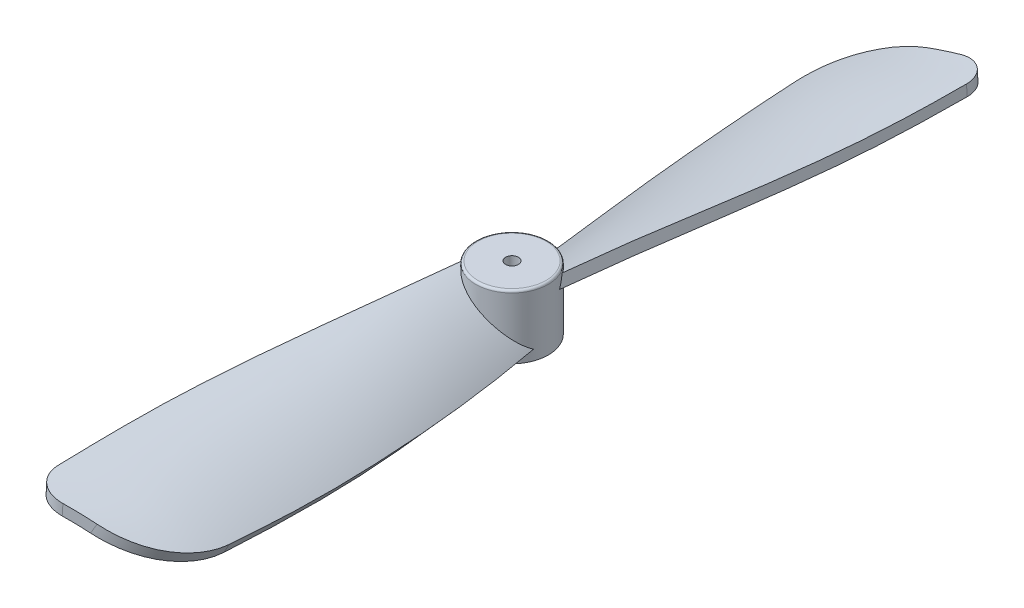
ISO-10303-21;
HEADER;
FILE_DESCRIPTION(('STEP AP214'),'2;1');
FILE_NAME('part.step','',(''),(''),'','','');
FILE_SCHEMA(('AUTOMOTIVE_DESIGN { 1 0 10303 214 1 1 1 1 }'));
ENDSEC;
DATA;
#1=APPLICATION_CONTEXT('core data for automotive mechanical design processes');
#2=APPLICATION_PROTOCOL_DEFINITION('international standard','automotive_design',2000,#1);
#3=PRODUCT_CONTEXT('',#1,'mechanical');
#4=PRODUCT('Part','Part','',(#3));
#5=PRODUCT_RELATED_PRODUCT_CATEGORY('part','',(#4));
#6=PRODUCT_DEFINITION_FORMATION('','',#4);
#7=PRODUCT_DEFINITION_CONTEXT('part definition',#1,'design');
#8=PRODUCT_DEFINITION('design','',#6,#7);
#9=PRODUCT_DEFINITION_SHAPE('','',#8);
#10=(LENGTH_UNIT() NAMED_UNIT(*) SI_UNIT(.MILLI.,.METRE.));
#11=(NAMED_UNIT(*) PLANE_ANGLE_UNIT() SI_UNIT($,.RADIAN.));
#12=(NAMED_UNIT(*) SI_UNIT($,.STERADIAN.) SOLID_ANGLE_UNIT());
#13=UNCERTAINTY_MEASURE_WITH_UNIT(LENGTH_MEASURE(1.E-05),#10,'distance_accuracy_value','');
#14=(GEOMETRIC_REPRESENTATION_CONTEXT(3) GLOBAL_UNCERTAINTY_ASSIGNED_CONTEXT((#13)) GLOBAL_UNIT_ASSIGNED_CONTEXT((#10,
#11,#12)) REPRESENTATION_CONTEXT('',''));
#15=CARTESIAN_POINT('',(0.,0.,0.));
#16=DIRECTION('',(0.,0.,1.));
#17=DIRECTION('',(1.,0.,0.));
#18=AXIS2_PLACEMENT_3D('',#15,#16,#17);
#19=CARTESIAN_POINT('',(30.2673232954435,12.6859658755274,0.));
#20=CARTESIAN_POINT('',(30.0890554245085,12.6952566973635,1.66850217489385));
#21=CARTESIAN_POINT('',(29.7186292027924,12.6894885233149,5.00699821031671));
#22=CARTESIAN_POINT('',(29.003851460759,12.5688703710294,9.96538046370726));
#23=CARTESIAN_POINT('',(28.4742617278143,12.4524729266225,15.0975382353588));
#24=CARTESIAN_POINT('',(28.3694650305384,12.3483845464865,18.968382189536));
#25=CARTESIAN_POINT('',(28.4058820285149,12.3031611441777,22.2609162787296));
#26=CARTESIAN_POINT('',(28.4638275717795,12.2958204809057,23.3920411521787));
#27=CARTESIAN_POINT('',(30.1975338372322,12.5069573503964,0.));
#28=CARTESIAN_POINT('',(30.0211774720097,12.5109443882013,1.66826823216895));
#29=CARTESIAN_POINT('',(29.6572866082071,12.4968026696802,5.00714578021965));
#30=CARTESIAN_POINT('',(28.9644936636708,12.3826311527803,9.96521509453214));
#31=CARTESIAN_POINT('',(28.4580647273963,12.2548664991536,15.0980506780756));
#32=CARTESIAN_POINT('',(28.3621770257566,12.1499695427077,18.9668459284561));
#33=CARTESIAN_POINT('',(28.3947646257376,12.1028939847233,22.2627506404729));
#34=CARTESIAN_POINT('',(28.4484312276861,12.0951856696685,23.3947559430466));
#35=CARTESIAN_POINT('',(30.1277443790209,12.3279488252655,0.));
#36=CARTESIAN_POINT('',(29.9532995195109,12.3266320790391,1.66803428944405));
#37=CARTESIAN_POINT('',(29.5959440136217,12.3041168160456,5.00729335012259));
#38=CARTESIAN_POINT('',(28.9251358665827,12.1963919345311,9.96504972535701));
#39=CARTESIAN_POINT('',(28.4418677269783,12.0572600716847,15.0985631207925));
#40=CARTESIAN_POINT('',(28.3548890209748,11.9515545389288,18.9653096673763));
#41=CARTESIAN_POINT('',(28.3836472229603,11.9026268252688,22.2645850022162));
#42=CARTESIAN_POINT('',(28.4330348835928,11.8945508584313,23.3974707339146));
#43=CARTESIAN_POINT('',(30.0579549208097,12.1489403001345,0.));
#44=CARTESIAN_POINT('',(29.885421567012,12.1423197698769,1.66780034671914));
#45=CARTESIAN_POINT('',(29.5346014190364,12.111430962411,5.00744092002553));
#46=CARTESIAN_POINT('',(28.8857780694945,12.010152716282,9.96488435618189));
#47=CARTESIAN_POINT('',(28.4256707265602,11.8596536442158,15.0990755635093));
#48=CARTESIAN_POINT('',(28.3476010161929,11.75313953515,18.9637734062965));
#49=CARTESIAN_POINT('',(28.372529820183,11.7023596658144,22.2664193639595));
#50=CARTESIAN_POINT('',(28.4176385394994,11.693916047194,23.4001855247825));
#51=B_SPLINE_SURFACE_WITH_KNOTS('',3,3,((#19,#20,#21,#22,#23,#24,#25,#26),(#27,#28,#29,#30,#31,
#32,#33,#34),(#35,#36,#37,#38,#39,#40,#41,#42),(#43,#44,#45,#46,#47,#48,#49,#50)),.UNSPECIFIED.,
.F.,.F.,.F.,(4,4),(4,1,1,1,1,4),(0.,1.),(0.,0.219456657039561,0.438850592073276,
0.657676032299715,0.876128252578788,1.),.UNSPECIFIED.);
#52=CARTESIAN_POINT('',(30.2673232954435,12.6859658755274,0.));
#53=CARTESIAN_POINT('',(30.0890554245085,12.6952566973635,1.66850217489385));
#54=CARTESIAN_POINT('',(29.7186292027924,12.6894885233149,5.00699821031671));
#55=CARTESIAN_POINT('',(29.003851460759,12.5688703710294,9.96538046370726));
#56=CARTESIAN_POINT('',(28.4742617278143,12.4524729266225,15.0975382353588));
#57=CARTESIAN_POINT('',(28.3694650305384,12.3483845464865,18.968382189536));
#58=CARTESIAN_POINT('',(28.4058820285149,12.3031611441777,22.2609162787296));
#59=CARTESIAN_POINT('',(28.4638275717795,12.2958204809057,23.3920411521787));
#60=B_SPLINE_CURVE_WITH_KNOTS('',3,(#52,#53,#54,#55,#56,#57,#58,#59),.UNSPECIFIED.,.F.,.F.,(4,1,
1,1,1,4),(0.,0.219456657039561,0.438850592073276,0.657676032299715,0.876128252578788,1.),.UNSPECIFIED.);
#61=CARTESIAN_POINT('',(28.4059879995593,12.3131553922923,21.643018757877));
#62=VERTEX_POINT('',#61);
#63=CARTESIAN_POINT('',(30.1487103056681,12.6902553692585,1.09883385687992));
#64=VERTEX_POINT('',#63);
#65=EDGE_CURVE('E461',#62,#64,#60,.F.);
#66=CARTESIAN_POINT('',(30.1487103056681,12.6902553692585,1.09883385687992));
#67=CARTESIAN_POINT('',(30.1336139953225,12.6432364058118,1.07586590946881));
#68=CARTESIAN_POINT('',(30.1186751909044,12.5965356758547,1.05212609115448));
#69=CARTESIAN_POINT('',(30.0928422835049,12.5154064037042,1.00899071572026));
#70=CARTESIAN_POINT('',(30.081862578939,12.4808023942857,0.989974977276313));
#71=CARTESIAN_POINT('',(30.0601619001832,12.4121303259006,0.950866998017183));
#72=CARTESIAN_POINT('',(30.0494408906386,12.3780621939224,0.930774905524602));
#73=CARTESIAN_POINT('',(30.0282554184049,12.3104103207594,0.889319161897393));
#74=CARTESIAN_POINT('',(30.0177922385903,12.2768292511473,0.867950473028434));
#75=CARTESIAN_POINT('',(29.9972259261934,12.2104197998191,0.823884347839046));
#76=CARTESIAN_POINT('',(29.9871229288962,12.1775917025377,0.801186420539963));
#77=CARTESIAN_POINT('',(29.9772319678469,12.1452124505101,0.777764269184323));
#78=B_SPLINE_CURVE_WITH_KNOTS('',3,(#66,#67,#68,#69,#70,#71,#72,#73,#74,#75,#76,#77),
.UNSPECIFIED.,.F.,.F.,(4,2,2,2,2,4),(0.,0.163390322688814,0.286323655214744,0.409240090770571,
0.532678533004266,0.656162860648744),.UNSPECIFIED.);
#79=CARTESIAN_POINT('',(29.9772319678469,12.1452124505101,0.777764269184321));
#80=VERTEX_POINT('',#79);
#81=EDGE_CURVE('E433',#64,#80,#78,.T.);
#82=CARTESIAN_POINT('',(30.0579549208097,12.1489403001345,0.));
#83=CARTESIAN_POINT('',(29.885421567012,12.1423197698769,1.66780034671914));
#84=CARTESIAN_POINT('',(29.5346014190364,12.111430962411,5.00744092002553));
#85=CARTESIAN_POINT('',(28.8857780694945,12.010152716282,9.96488435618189));
#86=CARTESIAN_POINT('',(28.4256707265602,11.8596536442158,15.0990755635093));
#87=CARTESIAN_POINT('',(28.3476010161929,11.75313953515,18.9637734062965));
#88=CARTESIAN_POINT('',(28.372529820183,11.7023596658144,22.2664193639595));
#89=CARTESIAN_POINT('',(28.4176385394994,11.693916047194,23.4001855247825));
#90=B_SPLINE_CURVE_WITH_KNOTS('',3,(#82,#83,#84,#85,#86,#87,#88,#89),.UNSPECIFIED.,.F.,.F.,(4,1,
1,1,1,4),(0.,0.219456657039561,0.438850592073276,0.657676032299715,0.876128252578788,1.),.UNSPECIFIED.);
#91=CARTESIAN_POINT('',(28.3732493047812,11.7135194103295,21.6418102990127));
#92=VERTEX_POINT('',#91);
#93=EDGE_CURVE('E465',#80,#92,#90,.T.);
#94=CARTESIAN_POINT('',(30.1067757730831,11.1800428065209,23.1023450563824));
#95=CARTESIAN_POINT('',(28.3681454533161,11.2775319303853,23.4089124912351));
#96=CARTESIAN_POINT('',(28.3486081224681,11.2616415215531,21.6409506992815));
#97=CARTESIAN_POINT('',(30.1129830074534,11.2941851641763,23.1012505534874));
#98=CARTESIAN_POINT('',(28.375883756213,11.3915359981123,23.4075480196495));
#99=CARTESIAN_POINT('',(28.354830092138,11.3758014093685,21.6411623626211));
#100=CARTESIAN_POINT('',(30.1191909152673,11.4083274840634,23.100155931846));
#101=CARTESIAN_POINT('',(28.383629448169,11.5055992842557,23.4061822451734));
#102=CARTESIAN_POINT('',(28.3610545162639,11.4899612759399,21.6413781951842));
#103=CARTESIAN_POINT('',(30.1273827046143,11.5589302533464,23.0987114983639));
#104=CARTESIAN_POINT('',(28.3938573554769,11.6561504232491,23.4043787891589));
#105=CARTESIAN_POINT('',(28.3692704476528,11.6405872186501,21.6416684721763));
#106=CARTESIAN_POINT('',(30.129365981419,11.5953907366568,23.098361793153));
#107=CARTESIAN_POINT('',(28.3963329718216,11.6925855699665,23.4039422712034));
#108=CARTESIAN_POINT('',(28.3712597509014,11.6770533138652,21.641739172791));
#109=CARTESIAN_POINT('',(30.1313493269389,11.6318512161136,23.0980120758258));
#110=CARTESIAN_POINT('',(28.3988093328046,11.7290266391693,23.4035056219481));
#111=CARTESIAN_POINT('',(28.3732493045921,11.7135194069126,21.641810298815));
#112=CARTESIAN_POINT('',(30.1324704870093,11.6524618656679,23.0978143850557));
#113=CARTESIAN_POINT('',(28.4002088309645,11.7496210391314,23.4032588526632));
#114=CARTESIAN_POINT('',(28.3743739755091,11.7341332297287,21.641850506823));
#115=CARTESIAN_POINT('',(30.1335916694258,11.6730725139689,23.0976166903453));
#116=CARTESIAN_POINT('',(28.4016085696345,11.7702173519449,23.4030120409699));
#117=CARTESIAN_POINT('',(28.3754987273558,11.754747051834,21.6418908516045));
#118=CARTESIAN_POINT('',(30.1378175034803,11.750754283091,23.0968715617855));
#119=CARTESIAN_POINT('',(28.4068837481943,11.8478322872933,23.4020818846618));
#120=CARTESIAN_POINT('',(28.3797382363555,11.832440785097,21.6420434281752));
#121=CARTESIAN_POINT('',(30.1409223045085,11.8078253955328,23.0963241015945));
#122=CARTESIAN_POINT('',(28.4107607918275,11.9048636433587,23.4013982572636));
#123=CARTESIAN_POINT('',(28.3828535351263,11.889520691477,21.6421565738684));
#124=CARTESIAN_POINT('',(30.1468867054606,11.917454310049,23.0952724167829));
#125=CARTESIAN_POINT('',(28.4182100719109,12.0144184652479,23.4000847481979));
#126=CARTESIAN_POINT('',(28.3888389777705,11.9991665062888,21.6423759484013));
#127=CARTESIAN_POINT('',(30.1497462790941,11.9700121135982,23.094768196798));
#128=CARTESIAN_POINT('',(28.4217820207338,12.066939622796,23.3994549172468));
#129=CARTESIAN_POINT('',(28.3917090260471,12.0517324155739,21.6424820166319));
#130=CARTESIAN_POINT('',(30.1554657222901,12.0751277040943,23.0937597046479));
#131=CARTESIAN_POINT('',(28.4289273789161,12.1719819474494,23.3981949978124));
#132=CARTESIAN_POINT('',(28.3974502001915,12.1568642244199,21.6426959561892));
#133=CARTESIAN_POINT('',(30.1583255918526,12.1276854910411,23.0932554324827));
#134=CARTESIAN_POINT('',(28.4325007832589,12.2245030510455,23.3975649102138));
#135=CARTESIAN_POINT('',(28.4003213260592,12.2094301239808,21.642803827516));
#136=CARTESIAN_POINT('',(30.1621134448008,12.1972937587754,23.092587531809));
#137=CARTESIAN_POINT('',(28.4372351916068,12.2940739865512,23.3967301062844));
#138=CARTESIAN_POINT('',(28.4041246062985,12.2790491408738,21.6429478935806));
#139=CARTESIAN_POINT('',(30.163041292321,12.2143442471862,23.0924239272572));
#140=CARTESIAN_POINT('',(28.4383947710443,12.311112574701,23.3965256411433));
#141=CARTESIAN_POINT('',(28.4050562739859,12.2961022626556,21.6429832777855));
#142=CARTESIAN_POINT('',(30.1639691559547,12.2313947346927,23.0922603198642));
#143=CARTESIAN_POINT('',(28.4395545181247,12.3281524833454,23.3963211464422));
#144=CARTESIAN_POINT('',(28.4059879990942,12.3131553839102,21.643018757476));
#145=CARTESIAN_POINT('',(30.1659014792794,12.2669020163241,23.0919195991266));
#146=CARTESIAN_POINT('',(28.4419705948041,12.3636464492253,23.3958951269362));
#147=CARTESIAN_POINT('',(28.4079285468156,12.3486681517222,21.6430930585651));
#148=CARTESIAN_POINT('',(30.167833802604,12.3024092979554,23.091578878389));
#149=CARTESIAN_POINT('',(28.4443858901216,12.399128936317,23.3954692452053));
#150=CARTESIAN_POINT('',(28.409869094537,12.3841809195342,21.6431673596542));
#151=CARTESIAN_POINT('',(30.1697661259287,12.3379165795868,23.0912381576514));
#152=CARTESIAN_POINT('',(28.4468004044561,12.4345999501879,23.3950435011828));
#153=CARTESIAN_POINT('',(28.4118096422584,12.4196936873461,21.6432416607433));
#154=(BOUNDED_SURFACE() B_SPLINE_SURFACE(3,2,((#94,#95,#96),(#97,#98,#99),(#100,#101,#102),
(#103,#104,#105),(#106,#107,#108),(#109,#110,#111),(#112,#113,#114),(#115,#116,#117),(#118,#119,
#120),(#121,#122,#123),(#124,#125,#126),(#127,#128,#129),(#130,#131,#132),(#133,#134,#135),
(#136,#137,#138),(#139,#140,#141),(#142,#143,#144),(#145,#146,#147),(#148,#149,#150),(#151,#152,
#153)),.UNSPECIFIED.,.F.,.F.,.F.) B_SPLINE_SURFACE_WITH_KNOTS((4,2,3,2,2,2,2,3,4),(3,3),(0.,
0.342948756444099,0.452496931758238,0.51442313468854,0.685897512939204,0.84381137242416,
1.00172523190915,1.0529547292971,1.15963909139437),(0.,1.),
.UNSPECIFIED.) GEOMETRIC_REPRESENTATION_ITEM() RATIONAL_B_SPLINE_SURFACE(((1.,0.646917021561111,
1.),(1.,0.647249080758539,1.),(1.,0.647582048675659,1.),(1.,0.648022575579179,1.),(1.,
0.648129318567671,1.),(1.,0.648236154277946,1.),(1.,0.648296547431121,1.),(1.,0.648356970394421,
1.),(1.,0.648584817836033,1.),(1.,0.648752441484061,1.),(1.,0.649074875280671,1.),(1.,
0.649229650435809,1.),(1.,0.649539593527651,1.),(1.,0.649694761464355,1.),(1.,0.649900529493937,
1.),(1.,0.649950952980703,1.),(1.,0.650001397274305,1.),(1.,0.650106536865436,1.),(1.,
0.650211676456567,1.),(1.,0.650316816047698,1.))) REPRESENTATION_ITEM('') SURFACE());
#155=CARTESIAN_POINT('',(28.3486081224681,11.2616415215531,21.6409506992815));
#156=CARTESIAN_POINT('',(28.354830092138,11.3758014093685,21.6411623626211));
#157=CARTESIAN_POINT('',(28.3610545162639,11.4899612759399,21.6413781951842));
#158=CARTESIAN_POINT('',(28.3692704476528,11.6405872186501,21.6416684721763));
#159=CARTESIAN_POINT('',(28.3712597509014,11.6770533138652,21.641739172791));
#160=CARTESIAN_POINT('',(28.3732493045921,11.7135194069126,21.641810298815));
#161=CARTESIAN_POINT('',(28.3743739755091,11.7341332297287,21.641850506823));
#162=CARTESIAN_POINT('',(28.3754987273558,11.754747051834,21.6418908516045));
#163=CARTESIAN_POINT('',(28.3797382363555,11.832440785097,21.6420434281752));
#164=CARTESIAN_POINT('',(28.3828535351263,11.889520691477,21.6421565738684));
#165=CARTESIAN_POINT('',(28.3888389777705,11.9991665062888,21.6423759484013));
#166=CARTESIAN_POINT('',(28.3917090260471,12.0517324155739,21.6424820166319));
#167=CARTESIAN_POINT('',(28.3974502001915,12.1568642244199,21.6426959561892));
#168=CARTESIAN_POINT('',(28.4003213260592,12.2094301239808,21.6428038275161));
#169=CARTESIAN_POINT('',(28.4041246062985,12.2790491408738,21.6429478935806));
#170=CARTESIAN_POINT('',(28.4050562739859,12.2961022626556,21.6429832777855));
#171=CARTESIAN_POINT('',(28.4059879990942,12.3131553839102,21.643018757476));
#172=CARTESIAN_POINT('',(28.4079285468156,12.3486681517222,21.6430930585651));
#173=CARTESIAN_POINT('',(28.409869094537,12.3841809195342,21.6431673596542));
#174=CARTESIAN_POINT('',(28.4118096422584,12.4196936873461,21.6432416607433));
#175=B_SPLINE_CURVE_WITH_KNOTS('',3,(#155,#156,#157,#158,#159,#160,#161,#162,#163,#164,#165,
#166,#167,#168,#169,#170,#171,#172,#173,#174),.UNSPECIFIED.,.F.,.F.,(4,2,3,2,2,2,2,3,4),(0.,
0.342948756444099,0.452496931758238,0.51442313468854,0.685897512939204,0.84381137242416,
1.00172523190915,1.0529547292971,1.15963909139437),.UNSPECIFIED.);
#176=EDGE_CURVE('E473',#92,#62,#175,.T.);
#177=ORIENTED_EDGE('',*,*,#65,.T.);
#178=ORIENTED_EDGE('',*,*,#81,.T.);
#179=ORIENTED_EDGE('',*,*,#93,.T.);
#180=ORIENTED_EDGE('',*,*,#176,.T.);
#181=EDGE_LOOP('',(#177,#178,#179,#180));
#182=FACE_BOUND('',#181,.T.);
#183=ADVANCED_FACE('F91',(#182),#51,.T.);
#184=CARTESIAN_POINT('',(30.0579549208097,12.1489403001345,0.));
#185=CARTESIAN_POINT('',(29.885421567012,12.1423197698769,1.66780034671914));
#186=CARTESIAN_POINT('',(29.5346014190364,12.111430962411,5.00744092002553));
#187=CARTESIAN_POINT('',(28.8857780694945,12.010152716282,9.96488435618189));
#188=CARTESIAN_POINT('',(28.4256707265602,11.8596536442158,15.0990755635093));
#189=CARTESIAN_POINT('',(28.3476010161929,11.75313953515,18.9637734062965));
#190=CARTESIAN_POINT('',(28.372529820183,11.7023596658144,22.2664193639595));
#191=CARTESIAN_POINT('',(28.4176385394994,11.693916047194,23.4001855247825));
#192=CARTESIAN_POINT('',(31.2834657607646,11.58209842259,0.));
#193=CARTESIAN_POINT('',(31.2387998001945,11.5426593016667,1.66700311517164));
#194=CARTESIAN_POINT('',(31.1925430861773,11.6711073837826,5.00233591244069));
#195=CARTESIAN_POINT('',(30.9191597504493,11.6598277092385,9.98392065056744));
#196=CARTESIAN_POINT('',(30.6700760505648,11.6694996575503,15.0282834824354));
#197=CARTESIAN_POINT('',(30.5992029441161,11.6394763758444,19.1792459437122));
#198=CARTESIAN_POINT('',(30.5636357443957,11.5554425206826,22.0089236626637));
#199=CARTESIAN_POINT('',(30.5700260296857,11.5587517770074,23.0206615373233));
#200=CARTESIAN_POINT('',(32.3597842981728,10.7369028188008,0.));
#201=CARTESIAN_POINT('',(32.4429857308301,10.6646451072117,1.66620588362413));
#202=CARTESIAN_POINT('',(32.6783464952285,10.7419928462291,4.9973908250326));
#203=CARTESIAN_POINT('',(32.8360256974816,10.8087664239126,10.0023980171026));
#204=CARTESIAN_POINT('',(32.8336226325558,10.9263730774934,14.9595599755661));
#205=CARTESIAN_POINT('',(32.7983870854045,11.0436876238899,19.3884245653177));
#206=CARTESIAN_POINT('',(32.7120864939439,11.0087352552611,21.7589492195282));
#207=CARTESIAN_POINT('',(32.6797583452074,11.023797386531,22.6486588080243));
#208=CARTESIAN_POINT('',(33.2010668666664,9.68076354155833,0.));
#209=CARTESIAN_POINT('',(33.4121356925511,9.57568723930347,1.66540865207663));
#210=CARTESIAN_POINT('',(33.8056247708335,9.43946134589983,4.99299852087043));
#211=CARTESIAN_POINT('',(34.4619281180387,9.53243873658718,10.0189433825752));
#212=CARTESIAN_POINT('',(34.7236711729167,9.69607471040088,14.8979867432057));
#213=CARTESIAN_POINT('',(34.7968115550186,10.0050621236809,19.5758475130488));
#214=CARTESIAN_POINT('',(34.7130945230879,10.0888083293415,21.5349729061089));
#215=CARTESIAN_POINT('',(34.642047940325,10.1156233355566,22.3026542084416));
#216=B_SPLINE_SURFACE_WITH_KNOTS('',3,3,((#184,#185,#186,#187,#188,#189,#190,#191),(#192,#193,
#194,#195,#196,#197,#198,#199),(#200,#201,#202,#203,#204,#205,#206,#207),(#208,#209,#210,#211,
#212,#213,#214,#215)),.UNSPECIFIED.,.F.,.F.,.F.,(4,4),(4,1,1,1,1,4),(0.,1.),(0.,
0.219456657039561,0.438850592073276,0.657676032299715,0.876128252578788,1.),.UNSPECIFIED.);
#217=CARTESIAN_POINT('',(29.9772319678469,12.1452124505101,0.777764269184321));
#218=CARTESIAN_POINT('',(29.9993093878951,12.1326231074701,0.830086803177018));
#219=CARTESIAN_POINT('',(30.02354234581,12.1190837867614,0.881257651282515));
#220=CARTESIAN_POINT('',(30.0759881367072,12.0901836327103,0.980947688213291));
#221=CARTESIAN_POINT('',(30.1041991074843,12.0748236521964,1.02946810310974));
#222=CARTESIAN_POINT('',(30.1641693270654,12.0424144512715,1.1233680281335));
#223=CARTESIAN_POINT('',(30.195913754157,12.0253723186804,1.16875945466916));
#224=CARTESIAN_POINT('',(30.2626831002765,11.9896156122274,1.25634465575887));
#225=CARTESIAN_POINT('',(30.2977083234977,11.9709008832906,1.29853813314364));
#226=CARTESIAN_POINT('',(30.407058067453,11.9123890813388,1.41984171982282));
#227=CARTESIAN_POINT('',(30.4857992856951,11.870148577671,1.49389540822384));
#228=CARTESIAN_POINT('',(30.6519185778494,11.7796229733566,1.62708453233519));
#229=CARTESIAN_POINT('',(30.7393034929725,11.7313330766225,1.68620801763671));
#230=CARTESIAN_POINT('',(30.9257523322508,11.6256813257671,1.79246523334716));
#231=CARTESIAN_POINT('',(31.0252064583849,11.567927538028,1.83852341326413));
#232=CARTESIAN_POINT('',(31.2270401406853,11.4466320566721,1.91317109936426));
#233=CARTESIAN_POINT('',(31.3294205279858,11.3830887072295,1.94175558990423));
#234=CARTESIAN_POINT('',(31.5460431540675,11.2432563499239,1.98459386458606));
#235=CARTESIAN_POINT('',(31.6602846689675,11.1663437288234,1.99680229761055));
#236=CARTESIAN_POINT('',(31.8855181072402,11.0073236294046,2.00209748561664));
#237=CARTESIAN_POINT('',(31.9965082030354,10.9252133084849,1.99517368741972));
#238=CARTESIAN_POINT('',(32.2292868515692,10.7442495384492,1.96167709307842));
#239=CARTESIAN_POINT('',(32.3501589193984,10.6447458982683,1.93228256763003));
#240=CARTESIAN_POINT('',(32.5820720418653,10.4422947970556,1.85310267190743));
#241=CARTESIAN_POINT('',(32.6931044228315,10.3393444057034,1.8032995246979));
#242=CARTESIAN_POINT('',(32.8516793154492,10.1832132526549,1.71434850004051));
#243=CARTESIAN_POINT('',(32.9035893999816,10.1304579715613,1.68200749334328));
#244=CARTESIAN_POINT('',(33.0042240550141,10.024911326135,1.61272636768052));
#245=CARTESIAN_POINT('',(33.052948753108,9.97211996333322,1.57578643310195));
#246=CARTESIAN_POINT('',(33.1468999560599,9.86695687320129,1.49751768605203));
#247=CARTESIAN_POINT('',(33.1921340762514,9.81458446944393,1.45619892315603));
#248=CARTESIAN_POINT('',(33.2790029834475,9.71053179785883,1.3691288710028));
#249=CARTESIAN_POINT('',(33.3206373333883,9.65885161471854,1.32337704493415));
#250=CARTESIAN_POINT('',(33.3603552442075,9.60772003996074,1.27542585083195));
#251=B_SPLINE_CURVE_WITH_KNOTS('',3,(#217,#218,#219,#220,#221,#222,#223,#224,#225,#226,#227,
#228,#229,#230,#231,#232,#233,#234,#235,#236,#237,#238,#239,#240,#241,#242,#243,#244,#245,#246,
#247,#248,#249,#250),.UNSPECIFIED.,.F.,.F.,(4,2,2,2,2,2,2,2,2,2,2,2,2,2,2,2,4),(0.,
0.17442793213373,0.348774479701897,0.522415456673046,0.696072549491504,1.04257701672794,
1.38935795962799,1.75949207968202,2.12973239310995,2.54289154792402,2.95627864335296,
3.43238393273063,3.90890481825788,4.15105554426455,4.39319656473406,4.63479342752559,
4.87641958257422),.UNSPECIFIED.);
#252=CARTESIAN_POINT('',(33.3603552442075,9.60772003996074,1.27542585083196));
#253=VERTEX_POINT('',#252);
#254=EDGE_CURVE('E602',#80,#253,#251,.T.);
#255=CARTESIAN_POINT('',(33.2010668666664,9.68076354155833,0.));
#256=CARTESIAN_POINT('',(33.4121356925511,9.57568723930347,1.66540865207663));
#257=CARTESIAN_POINT('',(33.8056247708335,9.43946134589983,4.99299852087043));
#258=CARTESIAN_POINT('',(34.4619281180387,9.53243873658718,10.0189433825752));
#259=CARTESIAN_POINT('',(34.7236711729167,9.69607471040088,14.8979867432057));
#260=CARTESIAN_POINT('',(34.7968115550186,10.0050621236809,19.5758475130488));
#261=CARTESIAN_POINT('',(34.7130945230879,10.0888083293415,21.5349729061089));
#262=CARTESIAN_POINT('',(34.642047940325,10.1156233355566,22.3026542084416));
#263=B_SPLINE_CURVE_WITH_KNOTS('',3,(#255,#256,#257,#258,#259,#260,#261,#262),.UNSPECIFIED.,.F.,
.F.,(4,1,1,1,1,4),(0.,0.219456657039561,0.438850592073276,0.657676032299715,0.876128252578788,
1.),.UNSPECIFIED.);
#264=CARTESIAN_POINT('',(34.7652610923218,9.94797640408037,18.8212882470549));
#265=VERTEX_POINT('',#264);
#266=EDGE_CURVE('E466',#253,#265,#263,.T.);
#267=CARTESIAN_POINT('',(33.5749569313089,7.80401803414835,18.768467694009));
#268=CARTESIAN_POINT('',(33.8413878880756,8.01427638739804,22.4438321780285));
#269=CARTESIAN_POINT('',(30.6691347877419,9.81633956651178,23.0031859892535));
#270=CARTESIAN_POINT('',(33.8217300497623,8.24795611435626,18.7789897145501));
#271=CARTESIAN_POINT('',(34.04213825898,8.47636724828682,22.4084344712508));
#272=CARTESIAN_POINT('',(30.9143655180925,10.2614500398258,22.9599451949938));
#273=CARTESIAN_POINT('',(34.0683844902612,8.69198877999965,18.7898258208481));
#274=CARTESIAN_POINT('',(34.2452823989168,8.94064524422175,22.3726146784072));
#275=CARTESIAN_POINT('',(31.1603663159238,10.706122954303,22.9165686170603));
#276=CARTESIAN_POINT('',(34.4404715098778,9.36238024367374,18.8065054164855));
#277=CARTESIAN_POINT('',(34.554656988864,9.64246408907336,22.318063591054));
#278=CARTESIAN_POINT('',(31.5328696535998,11.3766594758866,22.8508862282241));
#279=CARTESIAN_POINT('',(34.5660146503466,9.58866711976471,18.8121904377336));
#280=CARTESIAN_POINT('',(34.6591100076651,9.87853787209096,22.2996457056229));
#281=CARTESIAN_POINT('',(31.6587945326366,11.6028540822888,22.8286822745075));
#282=CARTESIAN_POINT('',(34.71609867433,9.85931084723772,18.8190396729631));
#283=CARTESIAN_POINT('',(34.7847002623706,10.1613085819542,22.2775007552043));
#284=CARTESIAN_POINT('',(31.8096299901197,11.8732166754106,22.8020859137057));
#285=CARTESIAN_POINT('',(34.740680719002,9.90364313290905,18.8201631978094));
#286=CARTESIAN_POINT('',(34.8052379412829,10.2075157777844,22.2738794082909));
#287=CARTESIAN_POINT('',(31.8343445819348,11.917497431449,22.7977280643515));
#288=CARTESIAN_POINT('',(34.7652610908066,9.94797640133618,18.8212882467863));
#289=CARTESIAN_POINT('',(34.8257995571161,10.2537425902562,22.2702538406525));
#290=CARTESIAN_POINT('',(31.8590670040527,11.961773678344,22.7933688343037));
#291=CARTESIAN_POINT('',(34.7714696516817,9.95917418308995,18.8215724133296));
#292=CARTESIAN_POINT('',(34.8309894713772,10.2654106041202,22.2693387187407));
#293=CARTESIAN_POINT('',(31.8653114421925,11.972957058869,22.7922677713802));
#294=CARTESIAN_POINT('',(34.7776781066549,9.97037202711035,18.8218566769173));
#295=CARTESIAN_POINT('',(34.8361809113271,10.2770798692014,22.2684233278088));
#296=CARTESIAN_POINT('',(31.8715563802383,11.9841401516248,22.7911666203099));
#297=CARTESIAN_POINT('',(34.8146743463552,10.0371015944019,18.8235512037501));
#298=CARTESIAN_POINT('',(34.867105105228,10.3465779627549,22.2629705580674));
#299=CARTESIAN_POINT('',(31.9087736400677,12.0507797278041,22.784604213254));
#300=CARTESIAN_POINT('',(34.845459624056,10.0926347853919,18.8249637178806));
#301=CARTESIAN_POINT('',(34.8928738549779,10.4044363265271,22.2584268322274));
#302=CARTESIAN_POINT('',(31.9397577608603,12.1062294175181,22.7791408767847));
#303=CARTESIAN_POINT('',(34.9070248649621,10.2037042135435,18.8277930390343));
#304=CARTESIAN_POINT('',(34.9444510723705,10.520134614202,22.2493323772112));
#305=CARTESIAN_POINT('',(32.0017506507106,12.217114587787,22.768209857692));
#306=CARTESIAN_POINT('',(34.9378048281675,10.2592404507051,18.8292098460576));
#307=CARTESIAN_POINT('',(34.9702595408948,10.5779746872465,22.2447816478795));
#308=CARTESIAN_POINT('',(32.0327594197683,12.2725500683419,22.7627421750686));
#309=CARTESIAN_POINT('',(34.9993593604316,10.3703159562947,18.832047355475));
#310=CARTESIAN_POINT('',(35.0219162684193,10.6936362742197,22.2356731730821));
#311=CARTESIAN_POINT('',(32.0948016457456,12.383406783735,22.7518024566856));
#312=CARTESIAN_POINT('',(35.0301339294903,10.4258552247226,18.833468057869));
#313=CARTESIAN_POINT('',(35.0477645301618,10.7514579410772,22.2311154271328));
#314=CARTESIAN_POINT('',(32.1258351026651,12.4388280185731,22.746330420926));
#315=CARTESIAN_POINT('',(35.0614244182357,10.4823321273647,18.8349144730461));
#316=CARTESIAN_POINT('',(35.0740863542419,10.8102839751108,22.2264741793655));
#317=CARTESIAN_POINT('',(32.1574042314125,12.4951760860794,22.7407639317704));
#318=CARTESIAN_POINT('',(35.0619430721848,10.4832682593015,18.834938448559));
#319=CARTESIAN_POINT('',(35.0745223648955,10.8112583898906,22.2263972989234));
#320=CARTESIAN_POINT('',(32.1579275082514,12.4961100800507,22.7406716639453));
#321=CARTESIAN_POINT('',(35.0624617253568,10.4842043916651,18.8349624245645));
#322=CARTESIAN_POINT('',(35.0749583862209,10.8122328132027,22.2263204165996));
#323=CARTESIAN_POINT('',(32.1584507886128,12.4970440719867,22.7405793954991));
#324=CARTESIAN_POINT('',(35.0927121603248,10.5388105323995,18.836362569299));
#325=CARTESIAN_POINT('',(35.1004445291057,10.8691372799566,22.2218265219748));
#326=CARTESIAN_POINT('',(32.1889857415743,12.5515169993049,22.7351952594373));
#327=CARTESIAN_POINT('',(35.1229625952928,10.5934166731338,18.8377627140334));
#328=CARTESIAN_POINT('',(35.1258966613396,10.9259658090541,22.2173386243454));
#329=CARTESIAN_POINT('',(32.2195206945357,12.605989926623,22.7298111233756));
#330=CARTESIAN_POINT('',(35.1532130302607,10.6480228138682,18.8391628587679));
#331=CARTESIAN_POINT('',(35.1513148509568,10.9827185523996,22.2128567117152));
#332=CARTESIAN_POINT('',(32.2500556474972,12.6604628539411,22.7244269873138));
#333=(BOUNDED_SURFACE() B_SPLINE_SURFACE(3,2,((#267,#268,#269),(#270,#271,#272),(#273,#274,
#275),(#276,#277,#278),(#279,#280,#281),(#282,#283,#284),(#285,#286,#287),(#288,#289,#290),
(#291,#292,#293),(#294,#295,#296),(#297,#298,#299),(#300,#301,#302),(#303,#304,#305),(#306,#307,
#308),(#309,#310,#311),(#312,#313,#314),(#315,#316,#317),(#318,#319,#320),(#321,#322,#323),
(#324,#325,#326),(#327,#328,#329),(#330,#331,#332)),.UNSPECIFIED.,.F.,.F.,
.F.) B_SPLINE_SURFACE_WITH_KNOTS((4,2,2,3,2,2,2,2,3,4),(3,3),(0.,1.53009064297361,
2.30959443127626,2.46228786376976,2.50085546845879,2.692116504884,2.88337754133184,
3.07463857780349,3.07786225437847,3.26589961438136),(0.,1.),
.UNSPECIFIED.) GEOMETRIC_REPRESENTATION_ITEM() RATIONAL_B_SPLINE_SURFACE(((1.,0.747220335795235,
1.),(1.,0.751510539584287,1.),(1.,0.755786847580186,1.),(1.,0.762209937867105,1.),(1.,
0.764372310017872,1.),(1.,0.766950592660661,1.),(1.,0.767372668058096,1.),(1.,0.767794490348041,
1.),(1.,0.767901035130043,1.),(1.,0.768007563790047,1.),(1.,0.768642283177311,1.),(1.,
0.769170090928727,1.),(1.,0.770224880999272,1.),(1.,0.770751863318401,1.),(1.,0.771804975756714,
1.),(1.,0.772331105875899,1.),(1.,0.772865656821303,1.),(1.,0.772874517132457,1.),(1.,
0.772883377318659,1.),(1.,0.773399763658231,1.),(1.,0.773916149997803,1.),(1.,0.774432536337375,1.))) REPRESENTATION_ITEM('') SURFACE());
#334=CARTESIAN_POINT('',(34.7652610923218,9.94797640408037,18.8212882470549));
#335=CARTESIAN_POINT('',(34.7653682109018,9.95475304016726,18.9371869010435));
#336=CARTESIAN_POINT('',(34.7611033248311,9.96372991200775,19.0529600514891));
#337=CARTESIAN_POINT('',(34.7437471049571,9.98568802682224,19.2834616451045));
#338=CARTESIAN_POINT('',(34.7306556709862,9.99866931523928,19.3981900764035));
#339=CARTESIAN_POINT('',(34.6955780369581,10.0282280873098,19.6257142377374));
#340=CARTESIAN_POINT('',(34.6735990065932,10.0448026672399,19.7385114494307));
#341=CARTESIAN_POINT('',(34.6207272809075,10.0810706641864,19.9614813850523));
#342=CARTESIAN_POINT('',(34.5898349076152,10.1007639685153,20.0716542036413));
#343=CARTESIAN_POINT('',(34.5191630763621,10.1427980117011,20.2887092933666));
#344=CARTESIAN_POINT('',(34.4793754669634,10.1651411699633,20.3955884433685));
#345=CARTESIAN_POINT('',(34.3911223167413,10.2120423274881,20.6051972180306));
#346=CARTESIAN_POINT('',(34.3426566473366,10.2366003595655,20.7079267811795));
#347=CARTESIAN_POINT('',(34.237391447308,10.287590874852,20.9084653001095));
#348=CARTESIAN_POINT('',(34.1805966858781,10.3140222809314,21.0062770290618));
#349=CARTESIAN_POINT('',(34.0590812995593,10.3685154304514,21.1963855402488));
#350=CARTESIAN_POINT('',(33.9943576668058,10.3965777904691,21.2886802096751));
#351=CARTESIAN_POINT('',(33.7896686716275,10.4826176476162,21.5554828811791));
#352=CARTESIAN_POINT('',(33.6386132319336,10.542724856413,21.7209932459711));
#353=CARTESIAN_POINT('',(33.3112264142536,10.6664232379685,22.0234250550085));
#354=CARTESIAN_POINT('',(33.1348776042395,10.7300167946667,22.1603266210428));
#355=CARTESIAN_POINT('',(32.853180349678,10.8261808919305,22.3429389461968));
#356=CARTESIAN_POINT('',(32.7553070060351,10.8587072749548,22.4004952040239));
#357=CARTESIAN_POINT('',(32.5548604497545,10.9233191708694,22.5069995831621));
#358=CARTESIAN_POINT('',(32.4522889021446,10.9554048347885,22.5559507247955));
#359=CARTESIAN_POINT('',(32.2432689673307,11.0186106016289,22.6449415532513));
#360=CARTESIAN_POINT('',(32.136826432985,11.049732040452,22.6849940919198));
#361=CARTESIAN_POINT('',(31.9206505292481,11.1106069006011,22.7561135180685));
#362=CARTESIAN_POINT('',(31.8109189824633,11.1403610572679,22.7871852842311));
#363=CARTESIAN_POINT('',(31.6589562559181,11.1799015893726,22.8235254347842));
#364=CARTESIAN_POINT('',(31.6178236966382,11.1904405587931,22.8327040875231));
#365=CARTESIAN_POINT('',(31.5352888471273,11.2112563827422,22.8498204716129));
#366=CARTESIAN_POINT('',(31.4938869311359,11.2215335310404,22.8577596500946));
#367=CARTESIAN_POINT('',(31.4523401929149,11.2316797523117,22.8650857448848));
#368=B_SPLINE_CURVE_WITH_KNOTS('',3,(#334,#335,#336,#337,#338,#339,#340,#341,#342,#343,#344,
#345,#346,#347,#348,#349,#350,#351,#352,#353,#354,#355,#356,#357,#358,#359,#360,#361,#362,#363,
#364,#365,#366,#367),.UNSPECIFIED.,.F.,.F.,(4,2,2,2,2,2,2,2,2,2,2,2,2,2,2,2,4),(0.,
0.34818705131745,0.696378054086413,1.04428872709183,1.39218683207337,1.7404050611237,
2.08862845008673,2.43665322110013,2.78481042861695,3.47740357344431,4.17047636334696,
4.52446194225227,4.87832302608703,5.23166967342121,5.58482400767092,5.71513532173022,
5.84529333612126),.UNSPECIFIED.);
#369=CARTESIAN_POINT('',(31.4523400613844,11.2316791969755,22.8650857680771));
#370=VERTEX_POINT('',#369);
#371=EDGE_CURVE('E409',#265,#370,#368,.T.);
#372=CARTESIAN_POINT('',(27.3292722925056,-6.17633699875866,23.5920938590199));
#373=DIRECTION('',(-0.173648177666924,0.,-0.984807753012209));
#374=DIRECTION('',(0.984807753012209,0.,-0.173648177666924));
#375=AXIS2_PLACEMENT_3D('',#372,#373,#374);
#376=CIRCLE('',#375,17.9043937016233);
#377=CARTESIAN_POINT('',(30.1242688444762,11.5016850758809,23.0992605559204));
#378=VERTEX_POINT('',#377);
#379=EDGE_CURVE('E435',#378,#370,#376,.T.);
#380=CARTESIAN_POINT('',(30.1242686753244,11.5016840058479,23.0992605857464));
#381=CARTESIAN_POINT('',(30.0830556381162,11.5084038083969,23.1065271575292));
#382=CARTESIAN_POINT('',(30.0415362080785,11.5150129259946,23.1120428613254));
#383=CARTESIAN_POINT('',(29.9581400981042,11.5279710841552,23.1195393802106));
#384=CARTESIAN_POINT('',(29.916263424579,11.5343201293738,23.1215202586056));
#385=CARTESIAN_POINT('',(29.7906017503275,11.552901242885,23.1221106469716));
#386=CARTESIAN_POINT('',(29.7066625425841,11.5646872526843,23.1153894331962));
#387=CARTESIAN_POINT('',(29.5409309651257,11.5868311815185,23.0878294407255));
#388=CARTESIAN_POINT('',(29.4591399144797,11.5971882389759,23.0669821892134));
#389=CARTESIAN_POINT('',(29.3000955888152,11.6163984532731,23.011729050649));
#390=CARTESIAN_POINT('',(29.2228412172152,11.6252519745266,22.9773264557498));
#391=CARTESIAN_POINT('',(29.0753443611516,11.6414589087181,22.8960461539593));
#392=CARTESIAN_POINT('',(29.0050810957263,11.6488168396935,22.8492070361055));
#393=CARTESIAN_POINT('',(28.8733286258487,11.6621631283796,22.7443225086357));
#394=CARTESIAN_POINT('',(28.8118399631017,11.6681514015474,22.68627640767));
#395=CARTESIAN_POINT('',(28.6995019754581,11.6788829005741,22.5607128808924));
#396=CARTESIAN_POINT('',(28.648638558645,11.6836277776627,22.4932082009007));
#397=CARTESIAN_POINT('',(28.5588961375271,11.6920285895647,22.3505462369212));
#398=CARTESIAN_POINT('',(28.5200225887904,11.6956840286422,22.2753854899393));
#399=CARTESIAN_POINT('',(28.455379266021,11.7020376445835,22.1195103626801));
#400=CARTESIAN_POINT('',(28.4296232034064,11.7047348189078,22.0387902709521));
#401=CARTESIAN_POINT('',(28.3920680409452,11.7092612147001,21.8742782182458));
#402=CARTESIAN_POINT('',(28.3802375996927,11.7110923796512,21.7904935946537));
#403=CARTESIAN_POINT('',(28.3742812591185,11.7128740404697,21.6848893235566));
#404=CARTESIAN_POINT('',(28.3735317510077,11.7132100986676,21.6633484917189));
#405=CARTESIAN_POINT('',(28.3732493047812,11.7135194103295,21.6418102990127));
#406=B_SPLINE_CURVE_WITH_KNOTS('',3,(#380,#381,#382,#383,#384,#385,#386,#387,#388,#389,#390,
#391,#392,#393,#394,#395,#396,#397,#398,#399,#400,#401,#402,#403,#404,#405),.UNSPECIFIED.,.F.,
.F.,(4,2,2,2,2,2,2,2,2,2,2,2,4),(0.,0.127077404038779,0.254152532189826,0.507929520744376,
0.761858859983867,1.0157265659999,1.26881557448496,1.5219202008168,1.774686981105,
2.02756860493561,2.28071402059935,2.53328860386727,2.5979358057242),.UNSPECIFIED.);
#407=EDGE_CURVE('E480',#378,#92,#406,.T.);
#408=ORIENTED_EDGE('',*,*,#93,.F.);
#409=ORIENTED_EDGE('',*,*,#254,.T.);
#410=ORIENTED_EDGE('',*,*,#266,.T.);
#411=ORIENTED_EDGE('',*,*,#371,.T.);
#412=ORIENTED_EDGE('',*,*,#379,.F.);
#413=ORIENTED_EDGE('',*,*,#407,.T.);
#414=EDGE_LOOP('',(#408,#409,#410,#411,#412,#413));
#415=FACE_BOUND('',#414,.T.);
#416=ADVANCED_FACE('F487',(#415),#216,.T.);
#417=CARTESIAN_POINT('',(33.5987736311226,10.0848312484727,0.));
#418=CARTESIAN_POINT('',(33.8396395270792,9.98528987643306,1.66363617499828));
#419=CARTESIAN_POINT('',(34.2694039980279,9.86345156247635,4.99321222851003));
#420=CARTESIAN_POINT('',(34.8022189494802,10.0096079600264,10.0208512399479));
#421=CARTESIAN_POINT('',(35.0789555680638,10.1932614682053,14.890171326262));
#422=CARTESIAN_POINT('',(35.0827331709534,10.5522782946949,19.5998005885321));
#423=CARTESIAN_POINT('',(34.9723910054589,10.6368108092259,21.5063376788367));
#424=CARTESIAN_POINT('',(34.8876435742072,10.6610721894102,22.2593490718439));
#425=CARTESIAN_POINT('',(32.7265899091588,11.2200845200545,0.));
#426=CARTESIAN_POINT('',(32.8277445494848,11.1568205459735,1.66525817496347));
#427=CARTESIAN_POINT('',(33.0611684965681,11.2406873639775,4.99735825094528));
#428=CARTESIAN_POINT('',(33.1100134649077,11.3299266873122,10.0039313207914));
#429=CARTESIAN_POINT('',(33.0983551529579,11.4840725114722,14.9534818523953));
#430=CARTESIAN_POINT('',(33.0067470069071,11.6422021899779,19.4070109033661));
#431=CARTESIAN_POINT('',(32.9033968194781,11.5962992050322,21.7367324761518));
#432=CARTESIAN_POINT('',(32.8662137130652,11.6100265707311,22.615781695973));
#433=CARTESIAN_POINT('',(31.5802127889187,12.1151545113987,0.));
#434=CARTESIAN_POINT('',(31.5416561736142,12.0881679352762,1.66688017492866));
#435=CARTESIAN_POINT('',(31.4789518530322,12.2223448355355,5.00209554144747));
#436=CARTESIAN_POINT('',(31.117142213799,12.2089867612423,9.98494489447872));
#437=CARTESIAN_POINT('',(30.8283134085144,12.2604883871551,15.0244404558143));
#438=CARTESIAN_POINT('',(30.7139086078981,12.2552870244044,19.1909509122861));
#439=CARTESIAN_POINT('',(30.6766949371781,12.1613854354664,21.9949353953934));
#440=CARTESIAN_POINT('',(30.6870761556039,12.1645787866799,23.0000224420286));
#441=CARTESIAN_POINT('',(30.2673232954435,12.6859658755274,0.));
#442=CARTESIAN_POINT('',(30.0890554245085,12.6952566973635,1.66850217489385));
#443=CARTESIAN_POINT('',(29.7186292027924,12.6894885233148,5.00699821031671));
#444=CARTESIAN_POINT('',(29.003851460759,12.5688703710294,9.96538046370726));
#445=CARTESIAN_POINT('',(28.4742617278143,12.4524729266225,15.0975382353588));
#446=CARTESIAN_POINT('',(28.3694650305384,12.3483845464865,18.968382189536));
#447=CARTESIAN_POINT('',(28.4058820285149,12.3031611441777,22.2609162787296));
#448=CARTESIAN_POINT('',(28.4638275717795,12.2958204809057,23.3920411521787));
#449=B_SPLINE_SURFACE_WITH_KNOTS('',3,3,((#417,#418,#419,#420,#421,#422,#423,#424),(#425,#426,
#427,#428,#429,#430,#431,#432),(#433,#434,#435,#436,#437,#438,#439,#440),(#441,#442,#443,#444,
#445,#446,#447,#448)),.UNSPECIFIED.,.F.,.F.,.F.,(4,4),(4,1,1,1,1,4),(0.,1.),(0.,
0.219456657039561,0.438850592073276,0.657676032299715,0.876128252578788,1.),.UNSPECIFIED.);
#450=CARTESIAN_POINT('',(33.5987736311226,10.0848312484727,0.));
#451=CARTESIAN_POINT('',(33.8396395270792,9.98528987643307,1.66363617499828));
#452=CARTESIAN_POINT('',(34.2694039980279,9.86345156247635,4.99321222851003));
#453=CARTESIAN_POINT('',(34.8022189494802,10.0096079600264,10.0208512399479));
#454=CARTESIAN_POINT('',(35.0789555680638,10.1932614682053,14.890171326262));
#455=CARTESIAN_POINT('',(35.0827331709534,10.5522782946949,19.5998005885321));
#456=CARTESIAN_POINT('',(34.9723910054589,10.6368108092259,21.5063376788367));
#457=CARTESIAN_POINT('',(34.8876435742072,10.6610721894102,22.2593490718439));
#458=B_SPLINE_CURVE_WITH_KNOTS('',3,(#450,#451,#452,#453,#454,#455,#456,#457),.UNSPECIFIED.,.F.,
.F.,(4,1,1,1,1,4),(0.,0.219456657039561,0.438850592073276,0.657676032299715,0.876128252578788,
1.),.UNSPECIFIED.);
#459=CARTESIAN_POINT('',(33.6971423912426,10.0458268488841,0.689646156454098));
#460=VERTEX_POINT('',#459);
#461=CARTESIAN_POINT('',(35.0624617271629,10.4842043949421,18.8349624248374));
#462=VERTEX_POINT('',#461);
#463=EDGE_CURVE('E575',#460,#462,#458,.T.);
#464=CARTESIAN_POINT('',(33.6971423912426,10.0458268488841,0.689646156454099));
#465=CARTESIAN_POINT('',(33.6840964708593,10.0663623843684,0.725152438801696));
#466=CARTESIAN_POINT('',(33.6701751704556,10.0875424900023,0.759943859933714));
#467=CARTESIAN_POINT('',(33.6406948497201,10.1309949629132,0.828098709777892));
#468=CARTESIAN_POINT('',(33.6251365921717,10.1532668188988,0.86146279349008));
#469=CARTESIAN_POINT('',(33.5762251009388,10.2213588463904,0.959327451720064));
#470=CARTESIAN_POINT('',(33.5405793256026,10.2685434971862,1.02174972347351));
#471=CARTESIAN_POINT('',(33.4641122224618,10.3650684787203,1.14071489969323));
#472=CARTESIAN_POINT('',(33.4233234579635,10.4143940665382,1.19729104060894));
#473=CARTESIAN_POINT('',(33.3368918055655,10.5146589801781,1.30507738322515));
#474=CARTESIAN_POINT('',(33.2912465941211,10.5655990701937,1.35628499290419));
#475=CARTESIAN_POINT('',(33.1605089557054,10.7060116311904,1.48877114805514));
#476=CARTESIAN_POINT('',(33.0709520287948,10.7964567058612,1.56470039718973));
#477=CARTESIAN_POINT('',(32.8800439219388,10.9777523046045,1.69988434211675));
#478=CARTESIAN_POINT('',(32.7786674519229,11.0686032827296,1.75910232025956));
#479=CARTESIAN_POINT('',(32.5436189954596,11.2673256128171,1.86983825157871));
#480=CARTESIAN_POINT('',(32.4076147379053,11.3748082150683,1.91719506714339));
#481=CARTESIAN_POINT('',(32.1245714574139,11.5840002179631,1.98194779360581));
#482=CARTESIAN_POINT('',(31.9775483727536,11.6857175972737,1.99938613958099));
#483=CARTESIAN_POINT('',(31.709573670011,11.8599927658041,2.00045605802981));
#484=CARTESIAN_POINT('',(31.5896854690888,11.9341674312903,1.99045833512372));
#485=CARTESIAN_POINT('',(31.3499099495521,12.0760650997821,1.94781209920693));
#486=CARTESIAN_POINT('',(31.2300226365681,12.1437895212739,1.91516857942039));
#487=CARTESIAN_POINT('',(31.0534686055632,12.2398371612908,1.84844317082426));
#488=CARTESIAN_POINT('',(30.994946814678,12.2710380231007,1.82311048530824));
#489=CARTESIAN_POINT('',(30.8797812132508,12.331402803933,1.76648246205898));
#490=CARTESIAN_POINT('',(30.8231364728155,12.3605677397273,1.73519013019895));
#491=CARTESIAN_POINT('',(30.7124732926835,12.4167280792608,1.66674552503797));
#492=CARTESIAN_POINT('',(30.6584518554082,12.443725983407,1.62960015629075));
#493=CARTESIAN_POINT('',(30.55369370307,12.495488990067,1.54961310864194));
#494=CARTESIAN_POINT('',(30.5029555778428,12.520255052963,1.506773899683));
#495=CARTESIAN_POINT('',(30.3971311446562,12.5715116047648,1.40786430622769));
#496=CARTESIAN_POINT('',(30.3427767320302,12.5975770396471,1.35078317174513));
#497=CARTESIAN_POINT('',(30.2405791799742,12.6464204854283,1.22977617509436));
#498=CARTESIAN_POINT('',(30.1927376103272,12.669197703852,1.16584866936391));
#499=CARTESIAN_POINT('',(30.1487103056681,12.6902553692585,1.09883385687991));
#500=B_SPLINE_CURVE_WITH_KNOTS('',3,(#464,#465,#466,#467,#468,#469,#470,#471,#472,#473,#474,
#475,#476,#477,#478,#479,#480,#481,#482,#483,#484,#485,#486,#487,#488,#489,#490,#491,#492,#493,
#494,#495,#496,#497,#498,#499),.UNSPECIFIED.,.F.,.F.,(4,2,2,2,2,2,2,2,2,2,2,2,2,2,2,2,2,4),(0.,
0.129077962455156,0.258096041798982,0.515588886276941,0.771526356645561,1.02758683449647,
1.47064330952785,1.91466581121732,2.45101101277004,2.98659485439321,3.40888997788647,
3.83109201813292,4.04382013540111,4.25644124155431,4.46881338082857,4.68109369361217,
4.92953977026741,5.17804562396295),.UNSPECIFIED.);
#501=EDGE_CURVE('E106',#460,#64,#500,.T.);
#502=CARTESIAN_POINT('',(28.4059879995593,12.3131553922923,21.643018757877));
#503=CARTESIAN_POINT('',(28.4067468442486,12.3126089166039,21.6852295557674));
#504=CARTESIAN_POINT('',(28.4092850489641,12.31197137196,21.7273869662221));
#505=CARTESIAN_POINT('',(28.4178965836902,12.3105071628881,21.8113337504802));
#506=CARTESIAN_POINT('',(28.4239697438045,12.3096805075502,21.8531231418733));
#507=CARTESIAN_POINT('',(28.4474316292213,12.3069092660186,21.9774210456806));
#508=CARTESIAN_POINT('',(28.470065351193,12.3046717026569,22.0589957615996));
#509=CARTESIAN_POINT('',(28.5286764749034,12.2993178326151,22.2171662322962));
#510=CARTESIAN_POINT('',(28.5646599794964,12.2962011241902,22.2937596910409));
#511=CARTESIAN_POINT('',(28.6489287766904,12.2889510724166,22.4397924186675));
#512=CARTESIAN_POINT('',(28.6972118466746,12.2848179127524,22.5092329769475));
#513=CARTESIAN_POINT('',(28.8046881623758,12.2753833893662,22.6389892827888));
#514=CARTESIAN_POINT('',(28.8638814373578,12.2700820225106,22.6993050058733));
#515=CARTESIAN_POINT('',(28.9914711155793,12.2581667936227,22.8091073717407));
#516=CARTESIAN_POINT('',(29.0598679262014,12.2515528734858,22.8585935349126));
#517=CARTESIAN_POINT('',(29.2038417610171,12.2369042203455,22.9453113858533));
#518=CARTESIAN_POINT('',(29.2794147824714,12.2288702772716,22.9825498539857));
#519=CARTESIAN_POINT('',(29.4356293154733,12.2113198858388,23.0437856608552));
#520=CARTESIAN_POINT('',(29.5162731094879,12.2018027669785,23.0677769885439));
#521=CARTESIAN_POINT('',(29.6803592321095,12.1813161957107,23.1018709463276));
#522=CARTESIAN_POINT('',(29.7638049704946,12.1703449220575,23.1119559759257));
#523=CARTESIAN_POINT('',(29.9308912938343,12.1471356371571,23.1179162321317));
#524=CARTESIAN_POINT('',(30.0145310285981,12.1349005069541,23.1138231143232));
#525=CARTESIAN_POINT('',(30.1172826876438,12.1190924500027,23.1000661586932));
#526=CARTESIAN_POINT('',(30.1374420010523,12.1159529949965,23.0969403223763));
#527=CARTESIAN_POINT('',(30.1575151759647,12.1127885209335,23.0933983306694));
#528=B_SPLINE_CURVE_WITH_KNOTS('',3,(#502,#503,#504,#505,#506,#507,#508,#509,#510,#511,#512,
#513,#514,#515,#516,#517,#518,#519,#520,#521,#522,#523,#524,#525,#526,#527),.UNSPECIFIED.,.F.,
.F.,(4,2,2,2,2,2,2,2,2,2,2,2,4),(0.,0.126585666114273,0.253165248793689,0.50592009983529,
0.758790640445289,1.01161551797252,1.26444107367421,1.51727782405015,1.76997436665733,
2.02278547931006,2.27591626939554,2.52848225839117,2.59038395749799),.UNSPECIFIED.);
#529=CARTESIAN_POINT('',(30.157515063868,12.1127877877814,23.093398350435));
#530=VERTEX_POINT('',#529);
#531=EDGE_CURVE('E479',#62,#530,#528,.T.);
#532=CARTESIAN_POINT('',(27.4328144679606,-5.71267633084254,23.5738365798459));
#533=DIRECTION('',(0.173648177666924,0.,0.984807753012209));
#534=DIRECTION('',(-0.984807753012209,0.,0.173648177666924));
#535=AXIS2_PLACEMENT_3D('',#532,#533,#534);
#536=CIRCLE('',#535,18.0389022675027);
#537=CARTESIAN_POINT('',(31.7593411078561,11.7830704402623,22.8109532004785));
#538=VERTEX_POINT('',#537);
#539=EDGE_CURVE('E360',#538,#530,#536,.T.);
#540=CARTESIAN_POINT('',(31.7593410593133,11.7830702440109,22.8109532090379));
#541=CARTESIAN_POINT('',(31.8743178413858,11.7537709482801,22.7906948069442));
#542=CARTESIAN_POINT('',(31.988197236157,11.7234482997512,22.7656591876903));
#543=CARTESIAN_POINT('',(32.2130130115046,11.6611927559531,22.7061312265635));
#544=CARTESIAN_POINT('',(32.3239492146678,11.6292597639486,22.6716383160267));
#545=CARTESIAN_POINT('',(32.5421888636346,11.564202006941,22.5932699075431));
#546=CARTESIAN_POINT('',(32.6494898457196,11.531076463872,22.5493881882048));
#547=CARTESIAN_POINT('',(32.8596578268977,11.4641808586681,22.4524665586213));
#548=CARTESIAN_POINT('',(32.9625250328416,11.430410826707,22.3994270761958));
#549=CARTESIAN_POINT('',(33.1632182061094,11.3627386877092,22.2844360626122));
#550=CARTESIAN_POINT('',(33.261040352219,11.3288365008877,22.2224779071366));
#551=CARTESIAN_POINT('',(33.4509322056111,11.2614280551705,22.0900325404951));
#552=CARTESIAN_POINT('',(33.5429998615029,11.2279219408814,22.0195423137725));
#553=CARTESIAN_POINT('',(33.7206093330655,11.1617952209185,21.8705787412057));
#554=CARTESIAN_POINT('',(33.8061575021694,11.1291737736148,21.7921133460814));
#555=CARTESIAN_POINT('',(33.9701887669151,11.0651298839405,21.6276663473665));
#556=CARTESIAN_POINT('',(34.0486719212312,11.0337074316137,21.5416848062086));
#557=CARTESIAN_POINT('',(34.1967975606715,10.9727882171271,21.3641682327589));
#558=CARTESIAN_POINT('',(34.2665570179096,10.9432693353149,21.2727384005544));
#559=CARTESIAN_POINT('',(34.3980104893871,10.8858503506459,21.0838287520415));
#560=CARTESIAN_POINT('',(34.4597076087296,10.8579496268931,20.986351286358));
#561=CARTESIAN_POINT('',(34.5745944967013,10.8039507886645,20.7859333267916));
#562=CARTESIAN_POINT('',(34.6277782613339,10.7778539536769,20.682989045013));
#563=CARTESIAN_POINT('',(34.7251842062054,10.7277877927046,20.4724487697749));
#564=CARTESIAN_POINT('',(34.7694063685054,10.7038184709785,20.3648527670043));
#565=CARTESIAN_POINT('',(34.8497208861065,10.6578092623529,20.1427956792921));
#566=CARTESIAN_POINT('',(34.8855573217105,10.6358402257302,20.0282272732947));
#567=CARTESIAN_POINT('',(34.947400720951,10.5951746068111,19.7958938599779));
#568=CARTESIAN_POINT('',(34.9734069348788,10.5764782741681,19.6781286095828));
#569=CARTESIAN_POINT('',(35.0156177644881,10.5429342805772,19.440184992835));
#570=CARTESIAN_POINT('',(35.0318119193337,10.528090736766,19.3200041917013));
#571=CARTESIAN_POINT('',(35.0544374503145,10.5027602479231,19.0782778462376));
#572=CARTESIAN_POINT('',(35.0608692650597,10.492273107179,18.9567323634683));
#573=CARTESIAN_POINT('',(35.062461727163,10.4842043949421,18.8349624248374));
#574=B_SPLINE_CURVE_WITH_KNOTS('',3,(#540,#541,#542,#543,#544,#545,#546,#547,#548,#549,#550,
#551,#552,#553,#554,#555,#556,#557,#558,#559,#560,#561,#562,#563,#564,#565,#566,#567,#568,#569,
#570,#571,#572,#573),.UNSPECIFIED.,.F.,.F.,(4,2,2,2,2,2,2,2,2,2,2,2,2,2,2,2,4),(0.,
0.361009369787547,0.722040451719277,1.08331151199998,1.44456569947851,1.80608960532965,
2.16774166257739,2.52903664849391,2.89032863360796,3.24608824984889,3.60171044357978,
3.95758234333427,4.31345495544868,4.67907722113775,5.04472736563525,5.41076665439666,
5.776789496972),.UNSPECIFIED.);
#575=EDGE_CURVE('E410',#538,#462,#574,.T.);
#576=ORIENTED_EDGE('',*,*,#463,.F.);
#577=ORIENTED_EDGE('',*,*,#501,.T.);
#578=ORIENTED_EDGE('',*,*,#65,.F.);
#579=ORIENTED_EDGE('',*,*,#531,.T.);
#580=ORIENTED_EDGE('',*,*,#539,.F.);
#581=ORIENTED_EDGE('',*,*,#575,.T.);
#582=EDGE_LOOP('',(#576,#577,#578,#579,#580,#581));
#583=FACE_BOUND('',#582,.T.);
#584=ADVANCED_FACE('F383',(#583),#449,.T.);
#585=CARTESIAN_POINT('',(33.2010668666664,9.68076354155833,0.));
#586=CARTESIAN_POINT('',(33.4121356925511,9.57568723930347,1.66540865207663));
#587=CARTESIAN_POINT('',(33.8056247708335,9.43946134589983,4.99299852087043));
#588=CARTESIAN_POINT('',(34.4619281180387,9.53243873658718,10.0189433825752));
#589=CARTESIAN_POINT('',(34.7236711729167,9.69607471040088,14.8979867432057));
#590=CARTESIAN_POINT('',(34.7968115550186,10.0050621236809,19.5758475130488));
#591=CARTESIAN_POINT('',(34.7130945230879,10.0888083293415,21.5349729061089));
#592=CARTESIAN_POINT('',(34.642047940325,10.1156233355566,22.3026542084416));
#593=CARTESIAN_POINT('',(33.3336357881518,9.81545277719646,0.));
#594=CARTESIAN_POINT('',(33.5546369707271,9.71222145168,1.66481782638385));
#595=CARTESIAN_POINT('',(33.960217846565,9.580791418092,4.9930697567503));
#596=CARTESIAN_POINT('',(34.5753583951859,9.69149514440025,10.0195793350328));
#597=CARTESIAN_POINT('',(34.8420993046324,9.86180362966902,14.8953816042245));
#598=CARTESIAN_POINT('',(34.8921187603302,10.1874675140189,19.5838318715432));
#599=CARTESIAN_POINT('',(34.7995266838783,10.2714758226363,21.5254278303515));
#600=CARTESIAN_POINT('',(34.7239131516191,10.2974396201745,22.288219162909));
#601=CARTESIAN_POINT('',(33.4662047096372,9.95014201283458,0.));
#602=CARTESIAN_POINT('',(33.6971382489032,9.84875566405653,1.66422700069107));
#603=CARTESIAN_POINT('',(34.1148109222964,9.72212149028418,4.99314099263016));
#604=CARTESIAN_POINT('',(34.6887886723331,9.85055155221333,10.0202152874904));
#605=CARTESIAN_POINT('',(34.9605274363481,10.0275325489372,14.8927764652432));
#606=CARTESIAN_POINT('',(34.9874259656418,10.3698729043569,19.5918162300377));
#607=CARTESIAN_POINT('',(34.8859588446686,10.4541433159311,21.5158827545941));
#608=CARTESIAN_POINT('',(34.8057783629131,10.4792559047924,22.2737841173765));
#609=CARTESIAN_POINT('',(33.5987736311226,10.0848312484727,0.));
#610=CARTESIAN_POINT('',(33.8396395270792,9.98528987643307,1.66363617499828));
#611=CARTESIAN_POINT('',(34.2694039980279,9.86345156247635,4.99321222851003));
#612=CARTESIAN_POINT('',(34.8022189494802,10.0096079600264,10.0208512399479));
#613=CARTESIAN_POINT('',(35.0789555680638,10.1932614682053,14.890171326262));
#614=CARTESIAN_POINT('',(35.0827331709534,10.5522782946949,19.5998005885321));
#615=CARTESIAN_POINT('',(34.9723910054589,10.6368108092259,21.5063376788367));
#616=CARTESIAN_POINT('',(34.8876435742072,10.6610721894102,22.2593490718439));
#617=B_SPLINE_SURFACE_WITH_KNOTS('',3,3,((#585,#586,#587,#588,#589,#590,#591,#592),(#593,#594,
#595,#596,#597,#598,#599,#600),(#601,#602,#603,#604,#605,#606,#607,#608),(#609,#610,#611,#612,
#613,#614,#615,#616)),.UNSPECIFIED.,.F.,.F.,.F.,(4,4),(4,1,1,1,1,4),(0.,1.),(0.,
0.219456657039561,0.438850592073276,0.657676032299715,0.876128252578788,1.),.UNSPECIFIED.);
#618=CARTESIAN_POINT('',(33.3603552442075,9.60772003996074,1.27542585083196));
#619=CARTESIAN_POINT('',(33.4136999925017,9.67093502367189,1.21096642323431));
#620=CARTESIAN_POINT('',(33.4640398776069,9.73234729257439,1.14194314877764));
#621=CARTESIAN_POINT('',(33.5467483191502,9.83705883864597,1.01108692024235));
#622=CARTESIAN_POINT('',(33.5806352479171,9.88137303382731,0.951006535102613));
#623=CARTESIAN_POINT('',(33.6431941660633,9.96655882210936,0.824774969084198));
#624=CARTESIAN_POINT('',(33.6718042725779,10.0073868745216,0.758563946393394));
#625=CARTESIAN_POINT('',(33.6971423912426,10.0458268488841,0.689646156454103));
#626=B_SPLINE_CURVE_WITH_KNOTS('',3,(#618,#619,#620,#621,#622,#623,#624,#625),.UNSPECIFIED.,.F.,
.F.,(4,2,2,4),(0.,0.314703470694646,0.560257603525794,0.808530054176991),.UNSPECIFIED.);
#627=EDGE_CURVE('E396',#253,#460,#626,.T.);
#628=CARTESIAN_POINT('',(35.1532130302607,10.6480228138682,18.8391628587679));
#629=CARTESIAN_POINT('',(35.1229625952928,10.5934166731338,18.8377627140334));
#630=CARTESIAN_POINT('',(35.0927121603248,10.5388105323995,18.836362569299));
#631=CARTESIAN_POINT('',(35.0624617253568,10.4842043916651,18.8349624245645));
#632=CARTESIAN_POINT('',(35.0619430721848,10.4832682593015,18.834938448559));
#633=CARTESIAN_POINT('',(35.0614244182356,10.4823321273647,18.8349144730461));
#634=CARTESIAN_POINT('',(35.0301339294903,10.4258552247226,18.833468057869));
#635=CARTESIAN_POINT('',(34.9993593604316,10.3703159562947,18.832047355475));
#636=CARTESIAN_POINT('',(34.9378048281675,10.2592404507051,18.8292098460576));
#637=CARTESIAN_POINT('',(34.9070248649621,10.2037042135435,18.8277930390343));
#638=CARTESIAN_POINT('',(34.845459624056,10.0926347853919,18.8249637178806));
#639=CARTESIAN_POINT('',(34.8146743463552,10.0371015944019,18.8235512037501));
#640=CARTESIAN_POINT('',(34.7776781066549,9.97037202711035,18.8218566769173));
#641=CARTESIAN_POINT('',(34.7714696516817,9.95917418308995,18.8215724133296));
#642=CARTESIAN_POINT('',(34.7652610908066,9.94797640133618,18.8212882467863));
#643=CARTESIAN_POINT('',(34.740680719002,9.90364313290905,18.8201631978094));
#644=CARTESIAN_POINT('',(34.71609867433,9.85931084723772,18.8190396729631));
#645=CARTESIAN_POINT('',(34.5660146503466,9.58866711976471,18.8121904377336));
#646=CARTESIAN_POINT('',(34.4404715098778,9.36238024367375,18.8065054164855));
#647=CARTESIAN_POINT('',(34.0683844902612,8.69198877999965,18.7898258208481));
#648=CARTESIAN_POINT('',(33.8217300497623,8.24795611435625,18.7789897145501));
#649=CARTESIAN_POINT('',(33.5749569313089,7.80401803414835,18.768467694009));
#650=B_SPLINE_CURVE_WITH_KNOTS('',3,(#628,#629,#630,#631,#632,#633,#634,#635,#636,#637,#638,
#639,#640,#641,#642,#643,#644,#645,#646,#647,#648,#649),.UNSPECIFIED.,.F.,.F.,(4,3,2,2,2,2,3,2,
2,4),(0.,0.188037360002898,0.191261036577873,0.382522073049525,0.573783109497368,
0.76504414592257,0.803611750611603,0.956305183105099,1.73580897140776,3.26589961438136),.UNSPECIFIED.);
#651=EDGE_CURVE('E403',#462,#265,#650,.T.);
#652=ORIENTED_EDGE('',*,*,#266,.F.);
#653=ORIENTED_EDGE('',*,*,#627,.T.);
#654=ORIENTED_EDGE('',*,*,#463,.T.);
#655=ORIENTED_EDGE('',*,*,#651,.T.);
#656=EDGE_LOOP('',(#652,#653,#654,#655));
#657=FACE_BOUND('',#656,.T.);
#658=ADVANCED_FACE('F377',(#657),#617,.T.);
#659=CARTESIAN_POINT('',(27.4328144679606,-5.71267633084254,23.5738365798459));
#660=DIRECTION('',(-0.173648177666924,0.,-0.984807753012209));
#661=DIRECTION('',(-0.984807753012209,0.,0.173648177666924));
#662=AXIS2_PLACEMENT_3D('',#659,#660,#661);
#663=PLANE('',#662);
#664=ORIENTED_EDGE('',*,*,#379,.T.);
#665=CARTESIAN_POINT('',(30.6691347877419,9.81633956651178,23.0031859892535));
#666=CARTESIAN_POINT('',(30.9143655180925,10.2614500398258,22.9599451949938));
#667=CARTESIAN_POINT('',(31.1603663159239,10.7061229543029,22.9165686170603));
#668=CARTESIAN_POINT('',(31.5328696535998,11.3766594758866,22.8508862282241));
#669=CARTESIAN_POINT('',(31.6587945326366,11.6028540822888,22.8286822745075));
#670=CARTESIAN_POINT('',(31.8096299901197,11.8732166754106,22.8020859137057));
#671=CARTESIAN_POINT('',(31.8343445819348,11.917497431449,22.7977280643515));
#672=CARTESIAN_POINT('',(31.8590670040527,11.961773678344,22.7933688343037));
#673=CARTESIAN_POINT('',(31.8653114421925,11.972957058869,22.7922677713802));
#674=CARTESIAN_POINT('',(31.8715563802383,11.9841401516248,22.7911666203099));
#675=CARTESIAN_POINT('',(31.9087736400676,12.0507797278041,22.784604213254));
#676=CARTESIAN_POINT('',(31.9397577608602,12.1062294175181,22.7791408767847));
#677=CARTESIAN_POINT('',(32.0017506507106,12.217114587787,22.768209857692));
#678=CARTESIAN_POINT('',(32.0327594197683,12.2725500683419,22.7627421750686));
#679=CARTESIAN_POINT('',(32.0948016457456,12.383406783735,22.7518024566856));
#680=CARTESIAN_POINT('',(32.1258351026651,12.4388280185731,22.746330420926));
#681=CARTESIAN_POINT('',(32.1574042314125,12.4951760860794,22.7407639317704));
#682=CARTESIAN_POINT('',(32.1579275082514,12.4961100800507,22.7406716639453));
#683=CARTESIAN_POINT('',(32.1584507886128,12.4970440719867,22.7405793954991));
#684=CARTESIAN_POINT('',(32.1889857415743,12.5515169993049,22.7351952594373));
#685=CARTESIAN_POINT('',(32.2195206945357,12.605989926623,22.7298111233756));
#686=CARTESIAN_POINT('',(32.2500556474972,12.6604628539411,22.7244269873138));
#687=B_SPLINE_CURVE_WITH_KNOTS('',3,(#665,#666,#667,#668,#669,#670,#671,#672,#673,#674,#675,
#676,#677,#678,#679,#680,#681,#682,#683,#684,#685,#686),.UNSPECIFIED.,.F.,.F.,(4,2,2,3,2,2,2,2,
3,4),(0.,1.53009064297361,2.30959443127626,2.46228786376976,2.50085546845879,2.692116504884,
2.88337754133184,3.07463857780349,3.07786225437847,3.26589961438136),.UNSPECIFIED.);
#688=EDGE_CURVE('E612',#370,#538,#687,.T.);
#689=ORIENTED_EDGE('',*,*,#688,.T.);
#690=ORIENTED_EDGE('',*,*,#539,.T.);
#691=CARTESIAN_POINT('',(30.1697661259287,12.3379165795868,23.0912381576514));
#692=CARTESIAN_POINT('',(30.167833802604,12.3024092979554,23.091578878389));
#693=CARTESIAN_POINT('',(30.1659014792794,12.2669020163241,23.0919195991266));
#694=CARTESIAN_POINT('',(30.1639691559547,12.2313947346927,23.0922603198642));
#695=CARTESIAN_POINT('',(30.163041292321,12.2143442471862,23.0924239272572));
#696=CARTESIAN_POINT('',(30.1621134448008,12.1972937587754,23.092587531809));
#697=CARTESIAN_POINT('',(30.1583255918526,12.1276854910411,23.0932554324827));
#698=CARTESIAN_POINT('',(30.1554657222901,12.0751277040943,23.0937597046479));
#699=CARTESIAN_POINT('',(30.1497462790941,11.9700121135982,23.094768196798));
#700=CARTESIAN_POINT('',(30.1468867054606,11.917454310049,23.0952724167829));
#701=CARTESIAN_POINT('',(30.1409223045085,11.8078253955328,23.0963241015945));
#702=CARTESIAN_POINT('',(30.1378175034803,11.750754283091,23.0968715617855));
#703=CARTESIAN_POINT('',(30.1335916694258,11.6730725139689,23.0976166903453));
#704=CARTESIAN_POINT('',(30.1324704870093,11.6524618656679,23.0978143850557));
#705=CARTESIAN_POINT('',(30.1313493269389,11.6318512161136,23.0980120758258));
#706=CARTESIAN_POINT('',(30.129365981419,11.5953907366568,23.098361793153));
#707=CARTESIAN_POINT('',(30.1273827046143,11.5589302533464,23.0987114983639));
#708=CARTESIAN_POINT('',(30.1191909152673,11.4083274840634,23.100155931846));
#709=CARTESIAN_POINT('',(30.1129830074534,11.2941851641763,23.1012505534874));
#710=CARTESIAN_POINT('',(30.1067757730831,11.1800428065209,23.1023450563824));
#711=B_SPLINE_CURVE_WITH_KNOTS('',3,(#691,#692,#693,#694,#695,#696,#697,#698,#699,#700,#701,
#702,#703,#704,#705,#706,#707,#708,#709,#710),.UNSPECIFIED.,.F.,.F.,(4,3,2,2,2,2,3,2,4),(0.,
0.106684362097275,0.157913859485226,0.315827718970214,0.473741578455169,0.645215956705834,
0.707142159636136,0.816690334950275,1.15963909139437),.UNSPECIFIED.);
#712=EDGE_CURVE('E546',#530,#378,#711,.T.);
#713=ORIENTED_EDGE('',*,*,#712,.T.);
#714=EDGE_LOOP('',(#664,#689,#690,#713));
#715=FACE_BOUND('',#714,.T.);
#716=ADVANCED_FACE('F374',(#715),#663,.F.);
#717=ORIENTED_EDGE('',*,*,#531,.F.);
#718=ORIENTED_EDGE('',*,*,#176,.F.);
#719=ORIENTED_EDGE('',*,*,#407,.F.);
#720=ORIENTED_EDGE('',*,*,#712,.F.);
#721=EDGE_LOOP('',(#717,#718,#719,#720));
#722=FACE_BOUND('',#721,.T.);
#723=ADVANCED_FACE('F368',(#722),#154,.T.);
#724=ORIENTED_EDGE('',*,*,#371,.F.);
#725=ORIENTED_EDGE('',*,*,#651,.F.);
#726=ORIENTED_EDGE('',*,*,#575,.F.);
#727=ORIENTED_EDGE('',*,*,#688,.F.);
#728=EDGE_LOOP('',(#724,#725,#726,#727));
#729=FACE_BOUND('',#728,.T.);
#730=ADVANCED_FACE('F363',(#729),#333,.T.);
#731=CARTESIAN_POINT('',(31.8198069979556,12.9807635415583,0.));
#732=DIRECTION('',(0.,-1.,0.));
#733=DIRECTION('',(0.,0.,-1.));
#734=AXIS2_PLACEMENT_3D('',#731,#732,#733);
#735=CYLINDRICAL_SURFACE('',#734,2.);
#736=CARTESIAN_POINT('',(31.8198069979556,12.8557635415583,0.));
#737=DIRECTION('',(0.,1.,0.));
#738=DIRECTION('',(0.,0.,1.));
#739=AXIS2_PLACEMENT_3D('',#736,#737,#738);
#740=CIRCLE('',#739,2.);
#741=CARTESIAN_POINT('',(31.8198069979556,12.8557635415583,2.));
#742=VERTEX_POINT('',#741);
#743=EDGE_CURVE('E12',#742,#742,#740,.F.);
#744=ORIENTED_EDGE('',*,*,#743,.T.);
#745=EDGE_LOOP('',(#744));
#746=FACE_BOUND('',#745,.T.);
#747=ORIENTED_EDGE('',*,*,#81,.F.);
#748=ORIENTED_EDGE('',*,*,#501,.F.);
#749=ORIENTED_EDGE('',*,*,#627,.F.);
#750=ORIENTED_EDGE('',*,*,#254,.F.);
#751=EDGE_LOOP('',(#747,#748,#749,#750));
#752=FACE_BOUND('',#751,.T.);
#753=CARTESIAN_POINT('',(33.4909005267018,12.6902553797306,-1.09883866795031));
#754=CARTESIAN_POINT('',(33.5059968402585,12.643236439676,-1.07587085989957));
#755=CARTESIAN_POINT('',(33.5209356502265,12.5965357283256,-1.05213118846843));
#756=CARTESIAN_POINT('',(33.5467685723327,12.5154064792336,-1.008996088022));
#757=CARTESIAN_POINT('',(33.5577482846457,12.4808024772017,-0.989980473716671));
#758=CARTESIAN_POINT('',(33.5794489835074,12.4121304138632,-0.950872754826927));
#759=CARTESIAN_POINT('',(33.5901700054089,12.3780622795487,-0.93078079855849));
#760=CARTESIAN_POINT('',(33.6113555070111,12.3104103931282,-0.889325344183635));
#761=CARTESIAN_POINT('',(33.6218187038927,12.2768293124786,-0.867956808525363));
#762=CARTESIAN_POINT('',(33.6423850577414,12.210419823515,-0.823891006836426));
#763=CARTESIAN_POINT('',(33.6524880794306,12.1775916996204,-0.801193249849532));
#764=CARTESIAN_POINT('',(33.6623790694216,12.1452124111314,-0.777771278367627));
#765=B_SPLINE_CURVE_WITH_KNOTS('',3,(#753,#754,#755,#756,#757,#758,#759,#760,#761,#762,#763,
#764),.UNSPECIFIED.,.F.,.F.,(4,2,2,2,2,4),(0.,0.163390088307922,0.28632323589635,
0.409239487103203,0.532677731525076,0.656161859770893),.UNSPECIFIED.);
#766=CARTESIAN_POINT('',(33.4909005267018,12.6902553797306,-1.09883866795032));
#767=VERTEX_POINT('',#766);
#768=CARTESIAN_POINT('',(33.6623790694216,12.1452124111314,-0.777771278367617));
#769=VERTEX_POINT('',#768);
#770=EDGE_CURVE('E196',#767,#769,#765,.T.);
#771=ORIENTED_EDGE('',*,*,#770,.F.);
#772=CARTESIAN_POINT('',(29.9424689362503,10.0458272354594,-0.689638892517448));
#773=CARTESIAN_POINT('',(29.955514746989,10.0663626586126,-0.725145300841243));
#774=CARTESIAN_POINT('',(29.9694359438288,10.0875426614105,-0.759936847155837));
#775=CARTESIAN_POINT('',(29.9989160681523,10.1309949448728,-0.828091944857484));
#776=CARTESIAN_POINT('',(30.0144742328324,10.1532667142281,-0.861456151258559));
#777=CARTESIAN_POINT('',(30.06338545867,10.2213585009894,-0.959321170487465));
#778=CARTESIAN_POINT('',(30.0990310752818,10.2685430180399,-1.02174367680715));
#779=CARTESIAN_POINT('',(30.1754978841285,10.3650677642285,-1.14070929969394));
#780=CARTESIAN_POINT('',(30.2162865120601,10.4143932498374,-1.19728565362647));
#781=CARTESIAN_POINT('',(30.3027179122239,10.5146579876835,-1.30507241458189));
#782=CARTESIAN_POINT('',(30.3483630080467,10.5655980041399,-1.35628022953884));
#783=CARTESIAN_POINT('',(30.4790999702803,10.7060099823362,-1.48876654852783));
#784=CARTESIAN_POINT('',(30.568656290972,10.796454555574,-1.56469582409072));
#785=CARTESIAN_POINT('',(30.7595631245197,10.9777492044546,-1.69987997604));
#786=CARTESIAN_POINT('',(30.8609389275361,11.0685997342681,-1.75909813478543));
#787=CARTESIAN_POINT('',(31.095986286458,11.2673215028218,-1.86983486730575));
#788=CARTESIAN_POINT('',(31.2319901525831,11.3748039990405,-1.91719225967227));
#789=CARTESIAN_POINT('',(31.5150327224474,11.5839958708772,-1.98194626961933));
#790=CARTESIAN_POINT('',(31.66205548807,11.6857132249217,-1.99938532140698));
#791=CARTESIAN_POINT('',(31.9300300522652,11.8599886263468,-2.00045663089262));
#792=CARTESIAN_POINT('',(32.0499184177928,11.9341635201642,-1.9904595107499));
#793=CARTESIAN_POINT('',(32.289694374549,12.0760616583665,-1.94781443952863));
#794=CARTESIAN_POINT('',(32.4095819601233,12.1437863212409,-1.91517148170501));
#795=CARTESIAN_POINT('',(32.5861364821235,12.2398343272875,-1.84844686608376));
#796=CARTESIAN_POINT('',(32.6446584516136,12.2710353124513,-1.82311443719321));
#797=CARTESIAN_POINT('',(32.7598244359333,12.331400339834,-1.76648690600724));
#798=CARTESIAN_POINT('',(32.816469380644,12.3605653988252,-1.73519480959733));
#799=CARTESIAN_POINT('',(32.9271329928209,12.4167259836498,-1.66675065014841));
#800=CARTESIAN_POINT('',(32.9811546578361,12.4437240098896,-1.6296054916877));
#801=CARTESIAN_POINT('',(33.0859132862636,12.4954872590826,-1.549618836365));
#802=CARTESIAN_POINT('',(33.1366516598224,12.5202534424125,-1.50677980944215));
#803=CARTESIAN_POINT('',(33.2424769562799,12.5715104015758,-1.40787029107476));
#804=CARTESIAN_POINT('',(33.2968319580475,12.5975761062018,-1.35078900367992));
#805=CARTESIAN_POINT('',(33.3990306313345,12.6464200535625,-1.22978158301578));
#806=CARTESIAN_POINT('',(33.4468727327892,12.6691975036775,-1.16585380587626));
#807=CARTESIAN_POINT('',(33.4909005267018,12.6902553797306,-1.09883866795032));
#808=B_SPLINE_CURVE_WITH_KNOTS('',3,(#772,#773,#774,#775,#776,#777,#778,#779,#780,#781,#782,
#783,#784,#785,#786,#787,#788,#789,#790,#791,#792,#793,#794,#795,#796,#797,#798,#799,#800,#801,
#802,#803,#804,#805,#806,#807),.UNSPECIFIED.,.F.,.F.,(4,2,2,2,2,2,2,2,2,2,2,2,2,2,2,2,2,4),(0.,
0.129078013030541,0.258096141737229,0.51558907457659,0.771526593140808,1.02758712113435,
1.47064163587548,1.91466218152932,2.45100677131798,2.98659001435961,3.40888578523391,
3.83108847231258,4.04381691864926,4.25643835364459,4.46881082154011,4.68109146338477,
4.92953925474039,5.17804683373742),.UNSPECIFIED.);
#809=CARTESIAN_POINT('',(29.9424689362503,10.0458272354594,-0.689638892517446));
#810=VERTEX_POINT('',#809);
#811=EDGE_CURVE('E114',#810,#767,#808,.T.);
#812=ORIENTED_EDGE('',*,*,#811,.F.);
#813=CARTESIAN_POINT('',(30.2792555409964,9.60772023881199,-1.27542197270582));
#814=CARTESIAN_POINT('',(30.2259109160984,9.67093514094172,-1.21096236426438));
#815=CARTESIAN_POINT('',(30.1755711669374,9.7323473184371,-1.14193890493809));
#816=CARTESIAN_POINT('',(30.0928628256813,9.83705889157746,-1.0110820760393));
#817=CARTESIAN_POINT('',(30.0589758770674,9.88137319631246,-0.951001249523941));
#818=CARTESIAN_POINT('',(29.9964169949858,9.9665591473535,-0.824768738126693));
#819=CARTESIAN_POINT('',(29.9678069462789,10.0073872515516,-0.7585572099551));
#820=CARTESIAN_POINT('',(29.9424689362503,10.0458272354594,-0.689638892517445));
#821=B_SPLINE_CURVE_WITH_KNOTS('',3,(#813,#814,#815,#816,#817,#818,#819,#820),.UNSPECIFIED.,.F.,
.F.,(4,2,2,4),(0.,0.314703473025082,0.560258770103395,0.808532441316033),.UNSPECIFIED.);
#822=CARTESIAN_POINT('',(30.2792555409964,9.60772023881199,-1.27542197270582));
#823=VERTEX_POINT('',#822);
#824=EDGE_CURVE('E177',#823,#810,#821,.T.);
#825=ORIENTED_EDGE('',*,*,#824,.F.);
#826=CARTESIAN_POINT('',(33.6623790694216,12.1452124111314,-0.777771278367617));
#827=CARTESIAN_POINT('',(33.6403014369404,12.1326229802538,-0.830093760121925));
#828=CARTESIAN_POINT('',(33.6160682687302,12.1190835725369,-0.881264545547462));
#829=CARTESIAN_POINT('',(33.5636220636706,12.0901832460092,-0.980954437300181));
#830=CARTESIAN_POINT('',(33.5354108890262,12.0748231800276,-1.02947476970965));
#831=CARTESIAN_POINT('',(33.4754402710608,12.0424138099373,-1.12337451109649));
#832=CARTESIAN_POINT('',(33.4436956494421,12.0253715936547,-1.16876583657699));
#833=CARTESIAN_POINT('',(33.3769259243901,11.9896147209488,-1.25635081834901));
#834=CARTESIAN_POINT('',(33.3419005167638,11.9708999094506,-1.29854417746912));
#835=CARTESIAN_POINT('',(33.2325502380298,11.9123878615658,-1.41984738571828));
#836=CARTESIAN_POINT('',(33.153808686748,11.8701471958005,-1.49390079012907));
#837=CARTESIAN_POINT('',(32.9876887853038,11.7796212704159,-1.62708929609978));
#838=CARTESIAN_POINT('',(32.9003035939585,11.7313312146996,-1.6862124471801));
#839=CARTESIAN_POINT('',(32.7138542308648,11.6256791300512,-1.79246894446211));
#840=CARTESIAN_POINT('',(32.614399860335,11.5679251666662,-1.83852673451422));
#841=CARTESIAN_POINT('',(32.4125657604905,11.4466293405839,-1.91317361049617));
#842=CARTESIAN_POINT('',(32.3101852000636,11.3830858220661,-1.94175768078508));
#843=CARTESIAN_POINT('',(32.0935622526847,11.2432531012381,-1.98459505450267));
#844=CARTESIAN_POINT('',(31.9793205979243,11.1663402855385,-1.99680299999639));
#845=CARTESIAN_POINT('',(31.7540869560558,11.0073198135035,-2.00209719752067));
#846=CARTESIAN_POINT('',(31.6430967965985,10.9252093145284,-1.99517289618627));
#847=CARTESIAN_POINT('',(31.4103180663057,10.7442451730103,-1.96167520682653));
#848=CARTESIAN_POINT('',(31.2894459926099,10.6447413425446,-1.93228008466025));
#849=CARTESIAN_POINT('',(31.0575329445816,10.4422899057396,-1.85309897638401));
#850=CARTESIAN_POINT('',(30.9465006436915,10.3393393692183,-1.80329521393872));
#851=CARTESIAN_POINT('',(30.7879264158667,10.1832085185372,-1.71434350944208));
#852=CARTESIAN_POINT('',(30.7360168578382,10.1304536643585,-1.68200249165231));
#853=CARTESIAN_POINT('',(30.6353832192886,10.0249078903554,-1.61272141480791));
#854=CARTESIAN_POINT('',(30.5866590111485,9.97211697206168,-1.57578154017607));
#855=CARTESIAN_POINT('',(30.4927087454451,9.86695478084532,-1.49751297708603));
#856=CARTESIAN_POINT('',(30.4474750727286,9.81458283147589,-1.45619433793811));
#857=CARTESIAN_POINT('',(30.360607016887,9.7105310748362,-1.3691245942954));
#858=CARTESIAN_POINT('',(30.3189730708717,9.65885135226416,-1.32337295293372));
#859=CARTESIAN_POINT('',(30.2792555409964,9.60772023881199,-1.27542197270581));
#860=B_SPLINE_CURVE_WITH_KNOTS('',3,(#826,#827,#828,#829,#830,#831,#832,#833,#834,#835,#836,
#837,#838,#839,#840,#841,#842,#843,#844,#845,#846,#847,#848,#849,#850,#851,#852,#853,#854,#855,
#856,#857,#858,#859),.UNSPECIFIED.,.F.,.F.,(4,2,2,2,2,2,2,2,2,2,2,2,2,2,2,2,4),(0.,
0.174428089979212,0.348774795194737,0.522415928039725,0.696073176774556,1.04257795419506,
1.38935920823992,1.75949372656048,2.12973443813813,2.54289413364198,2.95628177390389,
3.43238776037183,3.90890932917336,4.15105822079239,4.39319740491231,4.6347924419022,
4.87641677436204),.UNSPECIFIED.);
#861=EDGE_CURVE('E181',#769,#823,#860,.T.);
#862=ORIENTED_EDGE('',*,*,#861,.F.);
#863=EDGE_LOOP('',(#771,#812,#825,#862));
#864=FACE_BOUND('',#863,.T.);
#865=CARTESIAN_POINT('',(31.8198069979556,9.48076354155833,0.));
#866=DIRECTION('',(0.,1.,0.));
#867=DIRECTION('',(0.,0.,1.));
#868=AXIS2_PLACEMENT_3D('',#865,#866,#867);
#869=CIRCLE('',#868,2.);
#870=CARTESIAN_POINT('',(31.8198069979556,9.48076354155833,2.));
#871=VERTEX_POINT('',#870);
#872=EDGE_CURVE('E581',#871,#871,#869,.T.);
#873=ORIENTED_EDGE('',*,*,#872,.T.);
#874=EDGE_LOOP('',(#873));
#875=FACE_BOUND('',#874,.T.);
#876=ADVANCED_FACE('F179',(#746,#752,#864,#875),#735,.T.);
#877=CARTESIAN_POINT('',(31.8198069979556,12.9807635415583,0.));
#878=DIRECTION('',(0.,1.,0.));
#879=DIRECTION('',(0.,0.,1.));
#880=AXIS2_PLACEMENT_3D('',#877,#878,#879);
#881=PLANE('',#880);
#882=CARTESIAN_POINT('',(31.8198069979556,12.9807635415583,0.));
#883=DIRECTION('',(0.,1.,0.));
#884=DIRECTION('',(0.,0.,1.));
#885=AXIS2_PLACEMENT_3D('',#882,#883,#884);
#886=CIRCLE('',#885,1.875);
#887=CARTESIAN_POINT('',(31.8198069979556,12.9807635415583,1.875));
#888=VERTEX_POINT('',#887);
#889=EDGE_CURVE('E99',#888,#888,#886,.T.);
#890=ORIENTED_EDGE('',*,*,#889,.T.);
#891=EDGE_LOOP('',(#890));
#892=FACE_BOUND('',#891,.T.);
#893=CARTESIAN_POINT('',(31.8198069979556,12.9807635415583,0.));
#894=DIRECTION('',(0.,1.,0.));
#895=DIRECTION('',(0.,0.,1.));
#896=AXIS2_PLACEMENT_3D('',#893,#894,#895);
#897=CIRCLE('',#896,0.350000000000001);
#898=CARTESIAN_POINT('',(31.8198069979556,12.9807635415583,0.350000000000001));
#899=VERTEX_POINT('',#898);
#900=EDGE_CURVE('E582',#899,#899,#897,.T.);
#901=ORIENTED_EDGE('',*,*,#900,.F.);
#902=EDGE_LOOP('',(#901));
#903=FACE_BOUND('',#902,.T.);
#904=ADVANCED_FACE('F586',(#892,#903),#881,.T.);
#905=CARTESIAN_POINT('',(31.8198069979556,9.48076354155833,0.));
#906=DIRECTION('',(0.,1.,0.));
#907=DIRECTION('',(0.,0.,1.));
#908=AXIS2_PLACEMENT_3D('',#905,#906,#907);
#909=PLANE('',#908);
#910=CARTESIAN_POINT('',(31.8198069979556,9.48076354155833,0.));
#911=DIRECTION('',(0.,1.,0.));
#912=DIRECTION('',(0.,0.,1.));
#913=AXIS2_PLACEMENT_3D('',#910,#911,#912);
#914=CIRCLE('',#913,0.350000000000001);
#915=CARTESIAN_POINT('',(31.8198069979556,9.48076354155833,0.350000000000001));
#916=VERTEX_POINT('',#915);
#917=EDGE_CURVE('E579',#916,#916,#914,.T.);
#918=ORIENTED_EDGE('',*,*,#917,.T.);
#919=EDGE_LOOP('',(#918));
#920=FACE_BOUND('',#919,.T.);
#921=ORIENTED_EDGE('',*,*,#872,.F.);
#922=EDGE_LOOP('',(#921));
#923=FACE_BOUND('',#922,.T.);
#924=ADVANCED_FACE('F626',(#920,#923),#909,.F.);
#925=CARTESIAN_POINT('',(36.2067958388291,-5.71267633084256,-23.5738365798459));
#926=DIRECTION('',(0.173648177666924,0.,0.984807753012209));
#927=DIRECTION('',(0.984807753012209,0.,-0.173648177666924));
#928=AXIS2_PLACEMENT_3D('',#925,#926,#927);
#929=PLANE('',#928);
#930=CARTESIAN_POINT('',(36.2067958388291,-5.71267633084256,-23.5738365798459));
#931=DIRECTION('',(-0.173648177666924,0.,-0.984807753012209));
#932=DIRECTION('',(0.984807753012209,0.,-0.173648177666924));
#933=AXIS2_PLACEMENT_3D('',#930,#931,#932);
#934=CIRCLE('',#933,18.0389022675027);
#935=CARTESIAN_POINT('',(31.8802691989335,11.7830704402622,-22.8109532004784));
#936=VERTEX_POINT('',#935);
#937=CARTESIAN_POINT('',(33.4820952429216,12.1127877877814,-23.093398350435));
#938=VERTEX_POINT('',#937);
#939=EDGE_CURVE('E426',#936,#938,#934,.T.);
#940=ORIENTED_EDGE('',*,*,#939,.T.);
#941=CARTESIAN_POINT('',(33.5328345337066,11.1800428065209,-23.1023450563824));
#942=CARTESIAN_POINT('',(35.2714648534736,11.2775319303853,-23.4089124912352));
#943=CARTESIAN_POINT('',(35.2910021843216,11.2616415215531,-21.6409506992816));
#944=CARTESIAN_POINT('',(33.5266272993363,11.2941851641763,-23.1012505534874));
#945=CARTESIAN_POINT('',(35.2637265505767,11.3915359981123,-23.4075480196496));
#946=CARTESIAN_POINT('',(35.2847802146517,11.3758014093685,-21.6411623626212));
#947=CARTESIAN_POINT('',(33.5204193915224,11.4083274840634,-23.100155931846));
#948=CARTESIAN_POINT('',(35.2559808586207,11.5055992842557,-23.4061822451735));
#949=CARTESIAN_POINT('',(35.2785557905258,11.4899612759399,-21.6413781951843));
#950=CARTESIAN_POINT('',(33.5122276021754,11.5589302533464,-23.0987114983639));
#951=CARTESIAN_POINT('',(35.2457529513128,11.6561504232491,-23.4043787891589));
#952=CARTESIAN_POINT('',(35.2703398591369,11.6405872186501,-21.6416684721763));
#953=CARTESIAN_POINT('',(33.5102443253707,11.5953907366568,-23.098361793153));
#954=CARTESIAN_POINT('',(35.2432773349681,11.6925855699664,-23.4039422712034));
#955=CARTESIAN_POINT('',(35.2683505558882,11.6770533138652,-21.641739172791));
#956=CARTESIAN_POINT('',(33.5082609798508,11.6318512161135,-23.0980120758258));
#957=CARTESIAN_POINT('',(35.2408009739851,11.7290266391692,-23.4035056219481));
#958=CARTESIAN_POINT('',(35.2663610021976,11.7135194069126,-21.641810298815));
#959=CARTESIAN_POINT('',(33.5071398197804,11.6524618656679,-23.0978143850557));
#960=CARTESIAN_POINT('',(35.2394014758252,11.7496210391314,-23.4032588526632));
#961=CARTESIAN_POINT('',(35.2652363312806,11.7341332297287,-21.641850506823));
#962=CARTESIAN_POINT('',(33.5060186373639,11.6730725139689,-23.0976166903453));
#963=CARTESIAN_POINT('',(35.2380017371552,11.7702173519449,-23.4030120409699));
#964=CARTESIAN_POINT('',(35.2641115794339,11.7547470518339,-21.6418908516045));
#965=CARTESIAN_POINT('',(33.5017928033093,11.7507542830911,-23.0968715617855));
#966=CARTESIAN_POINT('',(35.2327265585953,11.8478322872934,-23.4020818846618));
#967=CARTESIAN_POINT('',(35.2598720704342,11.8324407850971,-21.6420434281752));
#968=CARTESIAN_POINT('',(33.4986880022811,11.807825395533,-23.0963241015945));
#969=CARTESIAN_POINT('',(35.2288495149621,11.9048636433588,-23.4013982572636));
#970=CARTESIAN_POINT('',(35.2567567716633,11.8895206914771,-21.6421565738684));
#971=CARTESIAN_POINT('',(33.4927236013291,11.9174543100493,-23.0952724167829));
#972=CARTESIAN_POINT('',(35.2214002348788,12.0144184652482,-23.4000847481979));
#973=CARTESIAN_POINT('',(35.2507713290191,11.9991665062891,-21.6423759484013));
#974=CARTESIAN_POINT('',(33.4898640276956,11.9700121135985,-23.094768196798));
#975=CARTESIAN_POINT('',(35.2178282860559,12.0669396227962,-23.3994549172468));
#976=CARTESIAN_POINT('',(35.2479012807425,12.0517324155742,-21.6424820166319));
#977=CARTESIAN_POINT('',(33.4841445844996,12.0751277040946,-23.0937597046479));
#978=CARTESIAN_POINT('',(35.2106829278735,12.1719819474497,-23.3981949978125));
#979=CARTESIAN_POINT('',(35.2421601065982,12.1568642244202,-21.6426959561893));
#980=CARTESIAN_POINT('',(33.481284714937,12.1276854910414,-23.0932554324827));
#981=CARTESIAN_POINT('',(35.2071095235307,12.2245030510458,-23.3975649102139));
#982=CARTESIAN_POINT('',(35.2392889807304,12.2094301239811,-21.6428038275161));
#983=CARTESIAN_POINT('',(33.4774968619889,12.1972937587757,-23.092587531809));
#984=CARTESIAN_POINT('',(35.2023751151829,12.2940739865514,-23.3967301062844));
#985=CARTESIAN_POINT('',(35.2354857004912,12.279049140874,-21.6429478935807));
#986=CARTESIAN_POINT('',(33.4765690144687,12.2143442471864,-23.0924239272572));
#987=CARTESIAN_POINT('',(35.2012155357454,12.3111125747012,-23.3965256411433));
#988=CARTESIAN_POINT('',(35.2345540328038,12.2961022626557,-21.6429832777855));
#989=CARTESIAN_POINT('',(33.4756411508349,12.2313947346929,-23.0922603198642));
#990=CARTESIAN_POINT('',(35.2000557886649,12.3281524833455,-23.3963211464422));
#991=CARTESIAN_POINT('',(35.2336223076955,12.3131553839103,-21.643018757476));
#992=CARTESIAN_POINT('',(33.4737088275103,12.2669020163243,-23.0919195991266));
#993=CARTESIAN_POINT('',(35.1976397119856,12.3636464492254,-23.3958951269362));
#994=CARTESIAN_POINT('',(35.2316817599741,12.3486681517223,-21.6430930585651));
#995=CARTESIAN_POINT('',(33.4717765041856,12.3024092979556,-23.091578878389));
#996=CARTESIAN_POINT('',(35.1952244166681,12.399128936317,-23.3954692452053));
#997=CARTESIAN_POINT('',(35.2297412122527,12.3841809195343,-21.6431673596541));
#998=CARTESIAN_POINT('',(33.469844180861,12.3379165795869,-23.0912381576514));
#999=CARTESIAN_POINT('',(35.1928099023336,12.434599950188,-23.3950435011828));
#1000=CARTESIAN_POINT('',(35.2278006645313,12.4196936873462,-21.6432416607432));
#1001=(BOUNDED_SURFACE() B_SPLINE_SURFACE(3,2,((#941,#942,#943),(#944,#945,#946),(#947,#948,
#949),(#950,#951,#952),(#953,#954,#955),(#956,#957,#958),(#959,#960,#961),(#962,#963,#964),
(#965,#966,#967),(#968,#969,#970),(#971,#972,#973),(#974,#975,#976),(#977,#978,#979),(#980,#981,
#982),(#983,#984,#985),(#986,#987,#988),(#989,#990,#991),(#992,#993,#994),(#995,#996,#997),
(#998,#999,#1000)),.UNSPECIFIED.,.F.,.F.,.F.) B_SPLINE_SURFACE_WITH_KNOTS((4,2,3,2,2,2,2,3,4),
(3,3),(0.,0.342948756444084,0.452496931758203,0.514423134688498,0.685897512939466,
0.843811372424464,1.00172523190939,1.0529547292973,1.15963909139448),(0.,1.),
.UNSPECIFIED.) GEOMETRIC_REPRESENTATION_ITEM() RATIONAL_B_SPLINE_SURFACE(((1.,0.64691702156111,
1.),(1.,0.647249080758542,1.),(1.,0.647582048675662,1.),(1.,0.64802257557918,1.),(1.,
0.648129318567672,1.),(1.,0.648236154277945,1.),(1.,0.648296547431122,1.),(1.,0.648356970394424,
1.),(1.,0.648584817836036,1.),(1.,0.648752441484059,1.),(1.,0.649074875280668,1.),(1.,
0.649229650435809,1.),(1.,0.649539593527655,1.),(1.,0.649694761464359,1.),(1.,0.649900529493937,
1.),(1.,0.649950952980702,1.),(1.,0.650001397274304,1.),(1.,0.650106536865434,1.),(1.,
0.650211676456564,1.),(1.,0.650316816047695,1.))) REPRESENTATION_ITEM('') SURFACE());
#1002=CARTESIAN_POINT('',(33.469844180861,12.3379165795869,-23.0912381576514));
#1003=CARTESIAN_POINT('',(33.4717765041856,12.3024092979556,-23.091578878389));
#1004=CARTESIAN_POINT('',(33.4737088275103,12.2669020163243,-23.0919195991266));
#1005=CARTESIAN_POINT('',(33.4756411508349,12.2313947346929,-23.0922603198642));
#1006=CARTESIAN_POINT('',(33.4765690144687,12.2143442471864,-23.0924239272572));
#1007=CARTESIAN_POINT('',(33.4774968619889,12.1972937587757,-23.092587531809));
#1008=CARTESIAN_POINT('',(33.481284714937,12.1276854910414,-23.0932554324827));
#1009=CARTESIAN_POINT('',(33.4841445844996,12.0751277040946,-23.0937597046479));
#1010=CARTESIAN_POINT('',(33.4898640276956,11.9700121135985,-23.094768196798));
#1011=CARTESIAN_POINT('',(33.4927236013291,11.9174543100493,-23.0952724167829));
#1012=CARTESIAN_POINT('',(33.4986880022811,11.807825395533,-23.0963241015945));
#1013=CARTESIAN_POINT('',(33.5017928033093,11.7507542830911,-23.0968715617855));
#1014=CARTESIAN_POINT('',(33.5060186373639,11.6730725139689,-23.0976166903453));
#1015=CARTESIAN_POINT('',(33.5071398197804,11.6524618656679,-23.0978143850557));
#1016=CARTESIAN_POINT('',(33.5082609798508,11.6318512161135,-23.0980120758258));
#1017=CARTESIAN_POINT('',(33.5102443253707,11.5953907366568,-23.098361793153));
#1018=CARTESIAN_POINT('',(33.5122276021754,11.5589302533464,-23.0987114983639));
#1019=CARTESIAN_POINT('',(33.5204193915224,11.4083274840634,-23.100155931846));
#1020=CARTESIAN_POINT('',(33.5266272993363,11.2941851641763,-23.1012505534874));
#1021=CARTESIAN_POINT('',(33.5328345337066,11.1800428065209,-23.1023450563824));
#1022=B_SPLINE_CURVE_WITH_KNOTS('',3,(#1002,#1003,#1004,#1005,#1006,#1007,#1008,#1009,#1010,
#1011,#1012,#1013,#1014,#1015,#1016,#1017,#1018,#1019,#1020,#1021),.UNSPECIFIED.,.F.,.F.,(4,3,2,
2,2,2,3,2,4),(0.,0.106684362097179,0.157913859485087,0.315827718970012,0.47374157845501,
0.645215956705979,0.707142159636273,0.816690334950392,1.15963909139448),.UNSPECIFIED.);
#1023=CARTESIAN_POINT('',(33.5153414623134,11.5016850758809,-23.0992605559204));
#1024=VERTEX_POINT('',#1023);
#1025=EDGE_CURVE('E777',#938,#1024,#1022,.T.);
#1026=ORIENTED_EDGE('',*,*,#1025,.T.);
#1027=CARTESIAN_POINT('',(36.3103380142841,-6.17633699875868,-23.5920938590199));
#1028=DIRECTION('',(0.173648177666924,0.,0.984807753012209));
#1029=DIRECTION('',(-0.984807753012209,0.,0.173648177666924));
#1030=AXIS2_PLACEMENT_3D('',#1027,#1028,#1029);
#1031=CIRCLE('',#1030,17.9043937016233);
#1032=CARTESIAN_POINT('',(32.1872702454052,11.2316791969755,-22.8650857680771));
#1033=VERTEX_POINT('',#1032);
#1034=EDGE_CURVE('E207',#1024,#1033,#1031,.T.);
#1035=ORIENTED_EDGE('',*,*,#1034,.T.);
#1036=CARTESIAN_POINT('',(30.064653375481,7.80401803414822,-18.7684676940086));
#1037=CARTESIAN_POINT('',(29.7982224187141,8.01427638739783,-22.4438321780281));
#1038=CARTESIAN_POINT('',(32.9704755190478,9.81633956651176,-23.0031859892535));
#1039=CARTESIAN_POINT('',(29.8178802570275,8.2479561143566,-18.7789897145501));
#1040=CARTESIAN_POINT('',(29.5974720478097,8.47636724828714,-22.4084344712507));
#1041=CARTESIAN_POINT('',(32.7252447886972,10.261450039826,-22.9599451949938));
#1042=CARTESIAN_POINT('',(29.5712258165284,8.69198878,-18.789825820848));
#1043=CARTESIAN_POINT('',(29.3943279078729,8.94064524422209,-22.3726146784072));
#1044=CARTESIAN_POINT('',(32.4792439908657,10.7061229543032,-22.9165686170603));
#1045=CARTESIAN_POINT('',(29.1991387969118,9.36238024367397,-18.8065054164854));
#1046=CARTESIAN_POINT('',(29.0849533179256,9.64246408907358,-22.3180635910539));
#1047=CARTESIAN_POINT('',(32.1067406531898,11.3766594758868,-22.8508862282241));
#1048=CARTESIAN_POINT('',(29.0735956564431,9.58866711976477,-18.8121904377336));
#1049=CARTESIAN_POINT('',(28.9805002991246,9.87853787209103,-22.2996457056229));
#1050=CARTESIAN_POINT('',(31.9808157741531,11.6028540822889,-22.8286822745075));
#1051=CARTESIAN_POINT('',(28.9235116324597,9.85931084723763,-18.8190396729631));
#1052=CARTESIAN_POINT('',(28.8549100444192,10.1613085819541,-22.2775007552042));
#1053=CARTESIAN_POINT('',(31.82998031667,11.8732166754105,-22.8020859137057));
#1054=CARTESIAN_POINT('',(28.8989295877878,9.90364313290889,-18.8201631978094));
#1055=CARTESIAN_POINT('',(28.8343723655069,10.2075157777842,-22.2738794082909));
#1056=CARTESIAN_POINT('',(31.805265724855,11.9174974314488,-22.7977280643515));
#1057=CARTESIAN_POINT('',(28.8743492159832,9.94797640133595,-18.8212882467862));
#1058=CARTESIAN_POINT('',(28.8138107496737,10.2537425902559,-22.2702538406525));
#1059=CARTESIAN_POINT('',(31.7805433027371,11.9617736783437,-22.7933688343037));
#1060=CARTESIAN_POINT('',(28.8681406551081,9.9591741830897,-18.8215724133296));
#1061=CARTESIAN_POINT('',(28.8086208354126,10.2654106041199,-22.2693387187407));
#1062=CARTESIAN_POINT('',(31.7742988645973,11.9729570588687,-22.7922677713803));
#1063=CARTESIAN_POINT('',(28.861932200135,9.97037202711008,-18.8218566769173));
#1064=CARTESIAN_POINT('',(28.8034293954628,10.2770798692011,-22.2684233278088));
#1065=CARTESIAN_POINT('',(31.7680539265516,11.9841401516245,-22.79116662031));
#1066=CARTESIAN_POINT('',(28.8249359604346,10.0371015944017,-18.8235512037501));
#1067=CARTESIAN_POINT('',(28.7725052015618,10.3465779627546,-22.2629705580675));
#1068=CARTESIAN_POINT('',(31.7308366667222,12.0507797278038,-22.784604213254));
#1069=CARTESIAN_POINT('',(28.7941506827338,10.0926347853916,-18.8249637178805));
#1070=CARTESIAN_POINT('',(28.7467364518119,10.4044363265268,-22.2584268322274));
#1071=CARTESIAN_POINT('',(31.6998525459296,12.1062294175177,-22.7791408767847));
#1072=CARTESIAN_POINT('',(28.7325854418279,10.2037042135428,-18.8277930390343));
#1073=CARTESIAN_POINT('',(28.6951592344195,10.5201346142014,-22.2493323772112));
#1074=CARTESIAN_POINT('',(31.6378596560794,12.2171145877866,-22.7682098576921));
#1075=CARTESIAN_POINT('',(28.7018054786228,10.2592404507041,-18.8292098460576));
#1076=CARTESIAN_POINT('',(28.6693507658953,10.5779746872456,-22.2447816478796));
#1077=CARTESIAN_POINT('',(31.6068508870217,12.2725500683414,-22.7627421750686));
#1078=CARTESIAN_POINT('',(28.6402509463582,10.3703159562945,-18.8320473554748));
#1079=CARTESIAN_POINT('',(28.6176940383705,10.6936362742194,-22.235673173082));
#1080=CARTESIAN_POINT('',(31.5448086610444,12.3834067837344,-22.7518024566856));
#1081=CARTESIAN_POINT('',(28.6094763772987,10.4258552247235,-18.8334680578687));
#1082=CARTESIAN_POINT('',(28.5918457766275,10.7514579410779,-22.2311154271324));
#1083=CARTESIAN_POINT('',(31.5137752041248,12.4388280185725,-22.746330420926));
#1084=CARTESIAN_POINT('',(28.5781858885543,10.4823321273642,-18.8349144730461));
#1085=CARTESIAN_POINT('',(28.565523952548,10.8102839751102,-22.2264741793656));
#1086=CARTESIAN_POINT('',(31.4822060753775,12.4951760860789,-22.7407639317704));
#1087=CARTESIAN_POINT('',(28.5776672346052,10.4832682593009,-18.834938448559));
#1088=CARTESIAN_POINT('',(28.5650879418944,10.81125838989,-22.2263972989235));
#1089=CARTESIAN_POINT('',(31.4816827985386,12.4961100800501,-22.7406716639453));
#1090=CARTESIAN_POINT('',(28.5771485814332,10.4842043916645,-18.8349624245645));
#1091=CARTESIAN_POINT('',(28.5646519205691,10.8122328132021,-22.2263204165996));
#1092=CARTESIAN_POINT('',(31.4811595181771,12.4970440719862,-22.7405793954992));
#1093=CARTESIAN_POINT('',(28.5468981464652,10.5388105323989,-18.8363625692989));
#1094=CARTESIAN_POINT('',(28.5391657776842,10.869137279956,-22.2218265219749));
#1095=CARTESIAN_POINT('',(31.4506245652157,12.5515169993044,-22.7351952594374));
#1096=CARTESIAN_POINT('',(28.5166477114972,10.5934166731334,-18.8377627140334));
#1097=CARTESIAN_POINT('',(28.5137136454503,10.9259658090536,-22.2173386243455));
#1098=CARTESIAN_POINT('',(31.4200896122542,12.6059899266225,-22.7298111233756));
#1099=CARTESIAN_POINT('',(28.4863972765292,10.6480228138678,-18.8391628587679));
#1100=CARTESIAN_POINT('',(28.4882954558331,10.9827185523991,-22.2128567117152));
#1101=CARTESIAN_POINT('',(31.3895546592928,12.6604628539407,-22.7244269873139));
#1102=(BOUNDED_SURFACE() B_SPLINE_SURFACE(3,2,((#1036,#1037,#1038),(#1039,#1040,#1041),(#1042,
#1043,#1044),(#1045,#1046,#1047),(#1048,#1049,#1050),(#1051,#1052,#1053),(#1054,#1055,#1056),
(#1057,#1058,#1059),(#1060,#1061,#1062),(#1063,#1064,#1065),(#1066,#1067,#1068),(#1069,#1070,
#1071),(#1072,#1073,#1074),(#1075,#1076,#1077),(#1078,#1079,#1080),(#1081,#1082,#1083),(#1084,
#1085,#1086),(#1087,#1088,#1089),(#1090,#1091,#1092),(#1093,#1094,#1095),(#1096,#1097,#1098),
(#1099,#1100,#1101)),.UNSPECIFIED.,.F.,.F.,.F.) B_SPLINE_SURFACE_WITH_KNOTS((4,2,2,3,2,2,2,2,3,
4),(3,3),(0.,1.53009064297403,2.30959443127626,2.46228786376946,2.50085546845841,
2.69211650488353,2.88337754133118,3.07463857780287,3.07786225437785,3.26589961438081),(0.,1.),
.UNSPECIFIED.) GEOMETRIC_REPRESENTATION_ITEM() RATIONAL_B_SPLINE_SURFACE(((1.,0.747220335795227,
1.),(1.,0.751510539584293,1.),(1.,0.75578684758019,1.),(1.,0.762209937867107,1.),(1.,
0.764372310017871,1.),(1.,0.76695059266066,1.),(1.,0.767372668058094,1.),(1.,0.767794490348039,
1.),(1.,0.767901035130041,1.),(1.,0.768007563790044,1.),(1.,0.768642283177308,1.),(1.,
0.769170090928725,1.),(1.,0.770224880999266,1.),(1.,0.770751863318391,1.),(1.,0.771804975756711,
1.),(1.,0.772331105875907,1.),(1.,0.772865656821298,1.),(1.,0.772874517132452,1.),(1.,
0.772883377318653,1.),(1.,0.773399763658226,1.),(1.,0.773916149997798,1.),(1.,0.774432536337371,1.))) REPRESENTATION_ITEM('') SURFACE());
#1103=CARTESIAN_POINT('',(32.9704755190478,9.81633956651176,-23.0031859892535));
#1104=CARTESIAN_POINT('',(32.7252447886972,10.261450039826,-22.9599451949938));
#1105=CARTESIAN_POINT('',(32.4792439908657,10.7061229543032,-22.9165686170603));
#1106=CARTESIAN_POINT('',(32.1067406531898,11.3766594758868,-22.8508862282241));
#1107=CARTESIAN_POINT('',(31.9808157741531,11.6028540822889,-22.8286822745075));
#1108=CARTESIAN_POINT('',(31.82998031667,11.8732166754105,-22.8020859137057));
#1109=CARTESIAN_POINT('',(31.805265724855,11.9174974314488,-22.7977280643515));
#1110=CARTESIAN_POINT('',(31.7805433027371,11.9617736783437,-22.7933688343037));
#1111=CARTESIAN_POINT('',(31.7742988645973,11.9729570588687,-22.7922677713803));
#1112=CARTESIAN_POINT('',(31.7680539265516,11.9841401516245,-22.79116662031));
#1113=CARTESIAN_POINT('',(31.7308366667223,12.0507797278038,-22.784604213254));
#1114=CARTESIAN_POINT('',(31.6998525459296,12.1062294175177,-22.7791408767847));
#1115=CARTESIAN_POINT('',(31.6378596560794,12.2171145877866,-22.7682098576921));
#1116=CARTESIAN_POINT('',(31.6068508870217,12.2725500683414,-22.7627421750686));
#1117=CARTESIAN_POINT('',(31.5448086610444,12.3834067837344,-22.7518024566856));
#1118=CARTESIAN_POINT('',(31.5137752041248,12.4388280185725,-22.746330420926));
#1119=CARTESIAN_POINT('',(31.4822060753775,12.4951760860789,-22.7407639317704));
#1120=CARTESIAN_POINT('',(31.4816827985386,12.4961100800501,-22.7406716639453));
#1121=CARTESIAN_POINT('',(31.4811595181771,12.4970440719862,-22.7405793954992));
#1122=CARTESIAN_POINT('',(31.4506245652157,12.5515169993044,-22.7351952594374));
#1123=CARTESIAN_POINT('',(31.4200896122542,12.6059899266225,-22.7298111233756));
#1124=CARTESIAN_POINT('',(31.3895546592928,12.6604628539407,-22.7244269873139));
#1125=B_SPLINE_CURVE_WITH_KNOTS('',3,(#1103,#1104,#1105,#1106,#1107,#1108,#1109,#1110,#1111,
#1112,#1113,#1114,#1115,#1116,#1117,#1118,#1119,#1120,#1121,#1122,#1123,#1124),.UNSPECIFIED.,
.F.,.F.,(4,2,2,3,2,2,2,2,3,4),(0.,1.53009064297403,2.30959443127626,2.46228786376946,
2.50085546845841,2.69211650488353,2.88337754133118,3.07463857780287,3.07786225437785,
3.26589961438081),.UNSPECIFIED.);
#1126=EDGE_CURVE('E333',#1033,#936,#1125,.T.);
#1127=ORIENTED_EDGE('',*,*,#1126,.T.);
#1128=EDGE_LOOP('',(#940,#1026,#1035,#1127));
#1129=FACE_BOUND('',#1128,.T.);
#1130=ADVANCED_FACE('F306',(#1129),#929,.F.);
#1131=CARTESIAN_POINT('',(35.2336223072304,12.3131553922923,-21.643018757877));
#1132=CARTESIAN_POINT('',(35.232863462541,12.3126089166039,-21.6852295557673));
#1133=CARTESIAN_POINT('',(35.2303252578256,12.31197137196,-21.7273869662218));
#1134=CARTESIAN_POINT('',(35.2217137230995,12.3105071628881,-21.8113337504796));
#1135=CARTESIAN_POINT('',(35.2156405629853,12.3096805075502,-21.8531231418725));
#1136=CARTESIAN_POINT('',(35.1921786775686,12.3069092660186,-21.97742104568));
#1137=CARTESIAN_POINT('',(35.1695449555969,12.3046717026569,-22.0589957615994));
#1138=CARTESIAN_POINT('',(35.1109338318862,12.2993178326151,-22.2171662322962));
#1139=CARTESIAN_POINT('',(35.0749503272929,12.2962011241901,-22.2937596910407));
#1140=CARTESIAN_POINT('',(34.990681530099,12.2889510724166,-22.4397924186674));
#1141=CARTESIAN_POINT('',(34.9423984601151,12.2848179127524,-22.5092329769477));
#1142=CARTESIAN_POINT('',(34.8349221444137,12.2753833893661,-22.6389892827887));
#1143=CARTESIAN_POINT('',(34.7757288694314,12.2700820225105,-22.6993050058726));
#1144=CARTESIAN_POINT('',(34.6481391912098,12.2581667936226,-22.80910737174));
#1145=CARTESIAN_POINT('',(34.5797423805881,12.2515528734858,-22.8585935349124));
#1146=CARTESIAN_POINT('',(34.4357685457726,12.2369042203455,-22.9453113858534));
#1147=CARTESIAN_POINT('',(34.3601955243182,12.2288702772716,-22.9825498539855));
#1148=CARTESIAN_POINT('',(34.2039809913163,12.2113198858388,-23.0437856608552));
#1149=CARTESIAN_POINT('',(34.1233371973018,12.2018027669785,-23.0677769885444));
#1150=CARTESIAN_POINT('',(33.9592510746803,12.1813161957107,-23.101870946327));
#1151=CARTESIAN_POINT('',(33.8758053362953,12.1703449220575,-23.1119559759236));
#1152=CARTESIAN_POINT('',(33.7087190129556,12.1471356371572,-23.1179162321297));
#1153=CARTESIAN_POINT('',(33.6250792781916,12.1349005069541,-23.1138231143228));
#1154=CARTESIAN_POINT('',(33.5223276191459,12.1190924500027,-23.1000661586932));
#1155=CARTESIAN_POINT('',(33.5021683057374,12.1159529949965,-23.0969403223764));
#1156=CARTESIAN_POINT('',(33.482095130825,12.1127885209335,-23.0933983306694));
#1157=B_SPLINE_CURVE_WITH_KNOTS('',3,(#1131,#1132,#1133,#1134,#1135,#1136,#1137,#1138,#1139,
#1140,#1141,#1142,#1143,#1144,#1145,#1146,#1147,#1148,#1149,#1150,#1151,#1152,#1153,#1154,#1155,
#1156),.UNSPECIFIED.,.F.,.F.,(4,2,2,2,2,2,2,2,2,2,2,2,4),(0.,0.126585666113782,
0.253165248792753,0.505920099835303,0.758790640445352,1.0116155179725,1.26444107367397,
1.51727782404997,1.76997436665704,2.02278547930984,2.27591626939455,2.52848225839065,
2.5903839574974),.UNSPECIFIED.);
#1158=CARTESIAN_POINT('',(35.2336223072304,12.3131553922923,-21.643018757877));
#1159=VERTEX_POINT('',#1158);
#1160=EDGE_CURVE('E186',#1159,#938,#1157,.T.);
#1161=ORIENTED_EDGE('',*,*,#1160,.F.);
#1162=CARTESIAN_POINT('',(35.2910021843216,11.2616415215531,-21.6409506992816));
#1163=CARTESIAN_POINT('',(35.2847802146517,11.3758014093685,-21.6411623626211));
#1164=CARTESIAN_POINT('',(35.2785557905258,11.4899612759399,-21.6413781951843));
#1165=CARTESIAN_POINT('',(35.2703398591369,11.6405872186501,-21.6416684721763));
#1166=CARTESIAN_POINT('',(35.2683505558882,11.6770533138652,-21.641739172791));
#1167=CARTESIAN_POINT('',(35.2663610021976,11.7135194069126,-21.641810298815));
#1168=CARTESIAN_POINT('',(35.2652363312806,11.7341332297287,-21.641850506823));
#1169=CARTESIAN_POINT('',(35.2641115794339,11.7547470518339,-21.6418908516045));
#1170=CARTESIAN_POINT('',(35.2598720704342,11.8324407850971,-21.6420434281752));
#1171=CARTESIAN_POINT('',(35.2567567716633,11.8895206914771,-21.6421565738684));
#1172=CARTESIAN_POINT('',(35.2507713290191,11.9991665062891,-21.6423759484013));
#1173=CARTESIAN_POINT('',(35.2479012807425,12.0517324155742,-21.6424820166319));
#1174=CARTESIAN_POINT('',(35.2421601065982,12.1568642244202,-21.6426959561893));
#1175=CARTESIAN_POINT('',(35.2392889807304,12.2094301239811,-21.6428038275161));
#1176=CARTESIAN_POINT('',(35.2354857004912,12.279049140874,-21.6429478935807));
#1177=CARTESIAN_POINT('',(35.2345540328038,12.2961022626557,-21.6429832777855));
#1178=CARTESIAN_POINT('',(35.2336223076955,12.3131553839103,-21.643018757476));
#1179=CARTESIAN_POINT('',(35.2316817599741,12.3486681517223,-21.6430930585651));
#1180=CARTESIAN_POINT('',(35.2297412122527,12.3841809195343,-21.6431673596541));
#1181=CARTESIAN_POINT('',(35.2278006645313,12.4196936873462,-21.6432416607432));
#1182=B_SPLINE_CURVE_WITH_KNOTS('',3,(#1162,#1163,#1164,#1165,#1166,#1167,#1168,#1169,#1170,
#1171,#1172,#1173,#1174,#1175,#1176,#1177,#1178,#1179,#1180,#1181),.UNSPECIFIED.,.F.,.F.,(4,2,3,
2,2,2,2,3,4),(0.,0.342948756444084,0.452496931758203,0.514423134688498,0.685897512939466,
0.843811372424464,1.00172523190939,1.0529547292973,1.15963909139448),.UNSPECIFIED.);
#1183=CARTESIAN_POINT('',(35.2663610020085,11.7135194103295,-21.6418102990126));
#1184=VERTEX_POINT('',#1183);
#1185=EDGE_CURVE('E776',#1184,#1159,#1182,.T.);
#1186=ORIENTED_EDGE('',*,*,#1185,.F.);
#1187=CARTESIAN_POINT('',(33.5153416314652,11.5016840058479,-23.0992605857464));
#1188=CARTESIAN_POINT('',(33.5565546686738,11.508403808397,-23.1065271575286));
#1189=CARTESIAN_POINT('',(33.5980740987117,11.5150129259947,-23.1120428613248));
#1190=CARTESIAN_POINT('',(33.6814702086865,11.5279710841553,-23.1195393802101));
#1191=CARTESIAN_POINT('',(33.7233468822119,11.534320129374,-23.1215202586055));
#1192=CARTESIAN_POINT('',(33.8490085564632,11.5529012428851,-23.122110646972));
#1193=CARTESIAN_POINT('',(33.9329477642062,11.5646872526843,-23.1153894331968));
#1194=CARTESIAN_POINT('',(34.098679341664,11.5868311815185,-23.0878294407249));
#1195=CARTESIAN_POINT('',(34.1804703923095,11.5971882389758,-23.0669821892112));
#1196=CARTESIAN_POINT('',(34.3395147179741,11.616398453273,-23.0117290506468));
#1197=CARTESIAN_POINT('',(34.4167690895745,11.6252519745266,-22.9773264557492));
#1198=CARTESIAN_POINT('',(34.5642659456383,11.6414589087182,-22.8960461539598));
#1199=CARTESIAN_POINT('',(34.6345292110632,11.6488168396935,-22.8492070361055));
#1200=CARTESIAN_POINT('',(34.7662816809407,11.6621631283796,-22.7443225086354));
#1201=CARTESIAN_POINT('',(34.827770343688,11.6681514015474,-22.6862764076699));
#1202=CARTESIAN_POINT('',(34.9401083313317,11.6788829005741,-22.5607128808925));
#1203=CARTESIAN_POINT('',(34.9909717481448,11.6836277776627,-22.4932082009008));
#1204=CARTESIAN_POINT('',(35.0807141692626,11.6920285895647,-22.3505462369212));
#1205=CARTESIAN_POINT('',(35.1195877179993,11.6956840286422,-22.2753854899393));
#1206=CARTESIAN_POINT('',(35.1842310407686,11.7020376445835,-22.1195103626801));
#1207=CARTESIAN_POINT('',(35.2099871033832,11.7047348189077,-22.0387902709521));
#1208=CARTESIAN_POINT('',(35.2475422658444,11.7092612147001,-21.8742782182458));
#1209=CARTESIAN_POINT('',(35.259372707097,11.7110923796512,-21.7904935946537));
#1210=CARTESIAN_POINT('',(35.2653290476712,11.7128740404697,-21.6848893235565));
#1211=CARTESIAN_POINT('',(35.266078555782,11.7132100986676,-21.6633484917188));
#1212=CARTESIAN_POINT('',(35.2663610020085,11.7135194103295,-21.6418102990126));
#1213=B_SPLINE_CURVE_WITH_KNOTS('',3,(#1187,#1188,#1189,#1190,#1191,#1192,#1193,#1194,#1195,
#1196,#1197,#1198,#1199,#1200,#1201,#1202,#1203,#1204,#1205,#1206,#1207,#1208,#1209,#1210,#1211,
#1212),.UNSPECIFIED.,.F.,.F.,(4,2,2,2,2,2,2,2,2,2,2,2,4),(0.,0.127077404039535,
0.254152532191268,0.507929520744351,0.761858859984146,1.01572656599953,1.26881557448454,
1.52192020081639,1.77468698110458,2.02756860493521,2.28071402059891,2.53328860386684,
2.59793580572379),.UNSPECIFIED.);
#1214=EDGE_CURVE('E779',#1024,#1184,#1213,.T.);
#1215=ORIENTED_EDGE('',*,*,#1214,.F.);
#1216=ORIENTED_EDGE('',*,*,#1025,.F.);
#1217=EDGE_LOOP('',(#1161,#1186,#1215,#1216));
#1218=FACE_BOUND('',#1217,.T.);
#1219=ADVANCED_FACE('F299',(#1218),#1001,.T.);
#1220=CARTESIAN_POINT('',(28.8743492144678,9.94797640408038,-18.8212882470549));
#1221=CARTESIAN_POINT('',(28.8742420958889,9.95475304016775,-18.937186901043));
#1222=CARTESIAN_POINT('',(28.8785069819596,9.96372991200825,-19.0529600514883));
#1223=CARTESIAN_POINT('',(28.8958632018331,9.98568802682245,-19.2834616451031));
#1224=CARTESIAN_POINT('',(28.9089546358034,9.99866931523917,-19.3981900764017));
#1225=CARTESIAN_POINT('',(28.9440322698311,10.0282280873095,-19.6257142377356));
#1226=CARTESIAN_POINT('',(28.9660113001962,10.0448026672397,-19.7385114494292));
#1227=CARTESIAN_POINT('',(29.0188830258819,10.0810706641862,-19.9614813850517));
#1228=CARTESIAN_POINT('',(29.0497753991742,10.1007639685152,-20.0716542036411));
#1229=CARTESIAN_POINT('',(29.1204472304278,10.1427980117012,-20.2887092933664));
#1230=CARTESIAN_POINT('',(29.1602348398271,10.1651411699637,-20.3955884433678));
#1231=CARTESIAN_POINT('',(29.2484879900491,10.2120423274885,-20.6051972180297));
#1232=CARTESIAN_POINT('',(29.296953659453,10.2366003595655,-20.7079267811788));
#1233=CARTESIAN_POINT('',(29.4022188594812,10.2875908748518,-20.908465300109));
#1234=CARTESIAN_POINT('',(29.4590136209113,10.3140222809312,-21.0062770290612));
#1235=CARTESIAN_POINT('',(29.5805290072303,10.3685154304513,-21.1963855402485));
#1236=CARTESIAN_POINT('',(29.6452526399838,10.3965777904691,-21.2886802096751));
#1237=CARTESIAN_POINT('',(29.8499416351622,10.4826176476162,-21.5554828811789));
#1238=CARTESIAN_POINT('',(30.0009970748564,10.5427248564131,-21.7209932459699));
#1239=CARTESIAN_POINT('',(30.3283838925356,10.6664232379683,-22.0234250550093));
#1240=CARTESIAN_POINT('',(30.5047327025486,10.7300167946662,-22.1603266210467));
#1241=CARTESIAN_POINT('',(30.7864299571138,10.8261808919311,-22.3429389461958));
#1242=CARTESIAN_POINT('',(30.8843033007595,10.8587072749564,-22.4004952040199));
#1243=CARTESIAN_POINT('',(31.0847498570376,10.9233191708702,-22.50699958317));
#1244=CARTESIAN_POINT('',(31.187321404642,10.9554048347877,-22.5559507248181));
#1245=CARTESIAN_POINT('',(31.3963413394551,11.0186106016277,-22.6449415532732));
#1246=CARTESIAN_POINT('',(31.5027838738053,11.0497320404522,-22.6849940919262));
#1247=CARTESIAN_POINT('',(31.7189597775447,11.110606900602,-22.7561135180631));
#1248=CARTESIAN_POINT('',(31.8286913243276,11.1403610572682,-22.7871852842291));
#1249=CARTESIAN_POINT('',(31.9806540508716,11.1799015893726,-22.8235254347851));
#1250=CARTESIAN_POINT('',(32.0217866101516,11.1904405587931,-22.8327040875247));
#1251=CARTESIAN_POINT('',(32.1043214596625,11.2112563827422,-22.8498204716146));
#1252=CARTESIAN_POINT('',(32.1457233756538,11.2215335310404,-22.8577596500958));
#1253=CARTESIAN_POINT('',(32.1872701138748,11.2316797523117,-22.8650857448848));
#1254=B_SPLINE_CURVE_WITH_KNOTS('',3,(#1220,#1221,#1222,#1223,#1224,#1225,#1226,#1227,#1228,
#1229,#1230,#1231,#1232,#1233,#1234,#1235,#1236,#1237,#1238,#1239,#1240,#1241,#1242,#1243,#1244,
#1245,#1246,#1247,#1248,#1249,#1250,#1251,#1252,#1253),.UNSPECIFIED.,.F.,.F.,(4,2,2,2,2,2,2,2,2,
2,2,2,2,2,2,2,4),(0.,0.348187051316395,0.696378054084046,1.04428872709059,1.39218683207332,
1.74040506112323,2.08862845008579,2.43665322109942,2.78481042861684,3.47740357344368,
4.1704763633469,4.52446194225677,4.87832302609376,5.2316696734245,5.58482400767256,
5.71513532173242,5.84529333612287),.UNSPECIFIED.);
#1255=CARTESIAN_POINT('',(28.8743492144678,9.94797640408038,-18.8212882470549));
#1256=VERTEX_POINT('',#1255);
#1257=EDGE_CURVE('E285',#1256,#1033,#1254,.T.);
#1258=ORIENTED_EDGE('',*,*,#1257,.F.);
#1259=CARTESIAN_POINT('',(28.4863972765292,10.6480228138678,-18.8391628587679));
#1260=CARTESIAN_POINT('',(28.5166477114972,10.5934166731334,-18.8377627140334));
#1261=CARTESIAN_POINT('',(28.5468981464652,10.5388105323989,-18.8363625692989));
#1262=CARTESIAN_POINT('',(28.5771485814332,10.4842043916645,-18.8349624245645));
#1263=CARTESIAN_POINT('',(28.5776672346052,10.4832682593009,-18.834938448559));
#1264=CARTESIAN_POINT('',(28.5781858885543,10.4823321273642,-18.8349144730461));
#1265=CARTESIAN_POINT('',(28.6094763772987,10.4258552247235,-18.8334680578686));
#1266=CARTESIAN_POINT('',(28.6402509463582,10.3703159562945,-18.8320473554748));
#1267=CARTESIAN_POINT('',(28.7018054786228,10.2592404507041,-18.8292098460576));
#1268=CARTESIAN_POINT('',(28.7325854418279,10.2037042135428,-18.8277930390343));
#1269=CARTESIAN_POINT('',(28.7941506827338,10.0926347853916,-18.8249637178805));
#1270=CARTESIAN_POINT('',(28.8249359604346,10.0371015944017,-18.8235512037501));
#1271=CARTESIAN_POINT('',(28.861932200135,9.97037202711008,-18.8218566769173));
#1272=CARTESIAN_POINT('',(28.8681406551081,9.9591741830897,-18.8215724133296));
#1273=CARTESIAN_POINT('',(28.8743492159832,9.94797640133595,-18.8212882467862));
#1274=CARTESIAN_POINT('',(28.8989295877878,9.90364313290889,-18.8201631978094));
#1275=CARTESIAN_POINT('',(28.9235116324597,9.85931084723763,-18.8190396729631));
#1276=CARTESIAN_POINT('',(29.0735956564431,9.58866711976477,-18.8121904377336));
#1277=CARTESIAN_POINT('',(29.1991387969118,9.36238024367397,-18.8065054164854));
#1278=CARTESIAN_POINT('',(29.5712258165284,8.69198878,-18.789825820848));
#1279=CARTESIAN_POINT('',(29.8178802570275,8.24795611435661,-18.7789897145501));
#1280=CARTESIAN_POINT('',(30.064653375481,7.80401803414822,-18.7684676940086));
#1281=B_SPLINE_CURVE_WITH_KNOTS('',3,(#1259,#1260,#1261,#1262,#1263,#1264,#1265,#1266,#1267,
#1268,#1269,#1270,#1271,#1272,#1273,#1274,#1275,#1276,#1277,#1278,#1279,#1280),.UNSPECIFIED.,
.F.,.F.,(4,3,2,2,2,2,3,2,2,4),(0.,0.188037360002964,0.191261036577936,0.382522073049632,
0.573783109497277,0.765044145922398,0.80361175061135,0.956305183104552,1.73580897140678,
3.26589961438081),.UNSPECIFIED.);
#1282=CARTESIAN_POINT('',(28.5771485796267,10.4842043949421,-18.8349624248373));
#1283=VERTEX_POINT('',#1282);
#1284=EDGE_CURVE('E200',#1283,#1256,#1281,.T.);
#1285=ORIENTED_EDGE('',*,*,#1284,.F.);
#1286=CARTESIAN_POINT('',(31.8802692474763,11.7830702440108,-22.8109532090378));
#1287=CARTESIAN_POINT('',(31.7652924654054,11.7537709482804,-22.7906948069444));
#1288=CARTESIAN_POINT('',(31.6514130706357,11.723448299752,-22.7656591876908));
#1289=CARTESIAN_POINT('',(31.4265972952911,11.6611927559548,-22.7061312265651));
#1290=CARTESIAN_POINT('',(31.3156610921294,11.6292597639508,-22.6716383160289));
#1291=CARTESIAN_POINT('',(31.0974214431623,11.5642020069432,-22.5932699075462));
#1292=CARTESIAN_POINT('',(30.9901204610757,11.5310764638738,-22.5493881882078));
#1293=CARTESIAN_POINT('',(30.7799524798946,11.464180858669,-22.4524665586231));
#1294=CARTESIAN_POINT('',(30.6770852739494,11.4304108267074,-22.3994270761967));
#1295=CARTESIAN_POINT('',(30.4763921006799,11.3627386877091,-22.2844360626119));
#1296=CARTESIAN_POINT('',(30.3785699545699,11.3288365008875,-22.2224779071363));
#1297=CARTESIAN_POINT('',(30.1886781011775,11.2614280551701,-22.0900325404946));
#1298=CARTESIAN_POINT('',(30.0966104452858,11.227921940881,-22.0195423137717));
#1299=CARTESIAN_POINT('',(29.9190009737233,11.1617952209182,-21.8705787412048));
#1300=CARTESIAN_POINT('',(29.8334528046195,11.1291737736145,-21.7921133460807));
#1301=CARTESIAN_POINT('',(29.6694215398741,11.0651298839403,-21.627666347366));
#1302=CARTESIAN_POINT('',(29.5909383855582,11.0337074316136,-21.5416848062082));
#1303=CARTESIAN_POINT('',(29.4428127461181,10.972788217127,-21.3641682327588));
#1304=CARTESIAN_POINT('',(29.3730532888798,10.9432693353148,-21.2727384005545));
#1305=CARTESIAN_POINT('',(29.2415998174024,10.8858503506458,-21.0838287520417));
#1306=CARTESIAN_POINT('',(29.1799026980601,10.8579496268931,-20.986351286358));
#1307=CARTESIAN_POINT('',(29.0650158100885,10.8039507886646,-20.7859333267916));
#1308=CARTESIAN_POINT('',(29.0118320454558,10.777853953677,-20.682989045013));
#1309=CARTESIAN_POINT('',(28.9144261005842,10.7277877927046,-20.4724487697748));
#1310=CARTESIAN_POINT('',(28.8702039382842,10.7038184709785,-20.3648527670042));
#1311=CARTESIAN_POINT('',(28.7898894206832,10.6578092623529,-20.1427956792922));
#1312=CARTESIAN_POINT('',(28.7540529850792,10.6358402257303,-20.0282272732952));
#1313=CARTESIAN_POINT('',(28.692209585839,10.5951746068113,-19.795893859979));
#1314=CARTESIAN_POINT('',(28.6662033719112,10.5764782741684,-19.6781286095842));
#1315=CARTESIAN_POINT('',(28.6239925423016,10.5429342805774,-19.4401849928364));
#1316=CARTESIAN_POINT('',(28.6077983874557,10.5280907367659,-19.3200041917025));
#1317=CARTESIAN_POINT('',(28.5851728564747,10.5027602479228,-19.0782778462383));
#1318=CARTESIAN_POINT('',(28.5787410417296,10.4922731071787,-18.9567323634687));
#1319=CARTESIAN_POINT('',(28.5771485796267,10.4842043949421,-18.8349624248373));
#1320=B_SPLINE_CURVE_WITH_KNOTS('',3,(#1286,#1287,#1288,#1289,#1290,#1291,#1292,#1293,#1294,
#1295,#1296,#1297,#1298,#1299,#1300,#1301,#1302,#1303,#1304,#1305,#1306,#1307,#1308,#1309,#1310,
#1311,#1312,#1313,#1314,#1315,#1316,#1317,#1318,#1319),.UNSPECIFIED.,.F.,.F.,(4,2,2,2,2,2,2,2,2,
2,2,2,2,2,2,2,4),(0.,0.361009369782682,0.722040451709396,1.08331151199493,1.44456569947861,
1.8060896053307,2.16774166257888,2.52903664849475,2.89032863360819,3.2460882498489,
3.60171044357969,3.95758234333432,4.31345495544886,4.67907722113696,5.04472736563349,
5.41076665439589,5.77678949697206),.UNSPECIFIED.);
#1321=EDGE_CURVE('E325',#936,#1283,#1320,.T.);
#1322=ORIENTED_EDGE('',*,*,#1321,.F.);
#1323=ORIENTED_EDGE('',*,*,#1126,.F.);
#1324=EDGE_LOOP('',(#1258,#1285,#1322,#1323));
#1325=FACE_BOUND('',#1324,.T.);
#1326=ADVANCED_FACE('F294',(#1325),#1102,.T.);
#1327=CARTESIAN_POINT('',(30.4385434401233,9.68076354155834,0.));
#1328=CARTESIAN_POINT('',(30.2274746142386,9.57568723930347,-1.66540865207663));
#1329=CARTESIAN_POINT('',(29.8339855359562,9.43946134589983,-4.99299852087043));
#1330=CARTESIAN_POINT('',(29.1776821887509,9.53243873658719,-10.0189433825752));
#1331=CARTESIAN_POINT('',(28.915939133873,9.69607471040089,-14.8979867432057));
#1332=CARTESIAN_POINT('',(28.8427987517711,10.0050621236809,-19.5758475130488));
#1333=CARTESIAN_POINT('',(28.9265157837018,10.0888083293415,-21.5349729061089));
#1334=CARTESIAN_POINT('',(28.9975623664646,10.1156233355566,-22.3026542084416));
#1335=CARTESIAN_POINT('',(30.3059745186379,9.81545277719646,0.));
#1336=CARTESIAN_POINT('',(30.0849733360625,9.71222145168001,-1.66481782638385));
#1337=CARTESIAN_POINT('',(29.6793924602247,9.58079141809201,-4.9930697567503));
#1338=CARTESIAN_POINT('',(29.0642519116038,9.69149514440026,-10.0195793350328));
#1339=CARTESIAN_POINT('',(28.7975110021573,9.86180362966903,-14.8953816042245));
#1340=CARTESIAN_POINT('',(28.7474915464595,10.1874675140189,-19.5838318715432));
#1341=CARTESIAN_POINT('',(28.8400836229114,10.2714758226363,-21.5254278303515));
#1342=CARTESIAN_POINT('',(28.9156971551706,10.2974396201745,-22.288219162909));
#1343=CARTESIAN_POINT('',(30.1734055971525,9.95014201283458,0.));
#1344=CARTESIAN_POINT('',(29.9424720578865,9.84875566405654,-1.66422700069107));
#1345=CARTESIAN_POINT('',(29.5247993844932,9.72212149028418,-4.99314099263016));
#1346=CARTESIAN_POINT('',(28.9508216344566,9.85055155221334,-10.0202152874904));
#1347=CARTESIAN_POINT('',(28.6790828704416,10.0275325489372,-14.8927764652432));
#1348=CARTESIAN_POINT('',(28.6521843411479,10.3698729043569,-19.5918162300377));
#1349=CARTESIAN_POINT('',(28.7536514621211,10.4541433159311,-21.5158827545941));
#1350=CARTESIAN_POINT('',(28.8338319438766,10.4792559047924,-22.2737841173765));
#1351=CARTESIAN_POINT('',(30.040836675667,10.0848312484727,0.));
#1352=CARTESIAN_POINT('',(29.7999707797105,9.98528987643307,-1.66363617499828));
#1353=CARTESIAN_POINT('',(29.3702063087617,9.86345156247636,-4.99321222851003));
#1354=CARTESIAN_POINT('',(28.8373913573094,10.0096079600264,-10.0208512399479));
#1355=CARTESIAN_POINT('',(28.5606547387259,10.1932614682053,-14.890171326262));
#1356=CARTESIAN_POINT('',(28.5568771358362,10.5522782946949,-19.5998005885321));
#1357=CARTESIAN_POINT('',(28.6672193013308,10.6368108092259,-21.5063376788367));
#1358=CARTESIAN_POINT('',(28.7519667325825,10.6610721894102,-22.2593490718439));
#1359=B_SPLINE_SURFACE_WITH_KNOTS('',3,3,((#1327,#1328,#1329,#1330,#1331,#1332,#1333,#1334),
(#1335,#1336,#1337,#1338,#1339,#1340,#1341,#1342),(#1343,#1344,#1345,#1346,#1347,#1348,#1349,
#1350),(#1351,#1352,#1353,#1354,#1355,#1356,#1357,#1358)),.UNSPECIFIED.,.F.,.F.,.F.,(4,4),(4,1,
1,1,1,4),(0.,1.),(0.,0.219456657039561,0.438850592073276,0.657676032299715,0.876128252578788,
1.),.UNSPECIFIED.);
#1360=CARTESIAN_POINT('',(30.4385434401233,9.68076354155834,0.));
#1361=CARTESIAN_POINT('',(30.2274746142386,9.57568723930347,-1.66540865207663));
#1362=CARTESIAN_POINT('',(29.8339855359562,9.43946134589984,-4.99299852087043));
#1363=CARTESIAN_POINT('',(29.1776821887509,9.53243873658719,-10.0189433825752));
#1364=CARTESIAN_POINT('',(28.915939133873,9.69607471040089,-14.8979867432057));
#1365=CARTESIAN_POINT('',(28.8427987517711,10.0050621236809,-19.5758475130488));
#1366=CARTESIAN_POINT('',(28.9265157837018,10.0888083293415,-21.5349729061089));
#1367=CARTESIAN_POINT('',(28.9975623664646,10.1156233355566,-22.3026542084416));
#1368=B_SPLINE_CURVE_WITH_KNOTS('',3,(#1360,#1361,#1362,#1363,#1364,#1365,#1366,#1367),
.UNSPECIFIED.,.F.,.F.,(4,1,1,1,1,4),(0.,0.219456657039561,0.438850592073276,0.657676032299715,
0.876128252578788,1.),.UNSPECIFIED.);
#1369=EDGE_CURVE('E192',#823,#1256,#1368,.T.);
#1370=CARTESIAN_POINT('',(30.040836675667,10.0848312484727,0.));
#1371=CARTESIAN_POINT('',(29.7999707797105,9.98528987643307,-1.66363617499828));
#1372=CARTESIAN_POINT('',(29.3702063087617,9.86345156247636,-4.99321222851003));
#1373=CARTESIAN_POINT('',(28.8373913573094,10.0096079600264,-10.0208512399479));
#1374=CARTESIAN_POINT('',(28.5606547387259,10.1932614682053,-14.890171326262));
#1375=CARTESIAN_POINT('',(28.5568771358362,10.5522782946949,-19.5998005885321));
#1376=CARTESIAN_POINT('',(28.6672193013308,10.6368108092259,-21.5063376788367));
#1377=CARTESIAN_POINT('',(28.7519667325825,10.6610721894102,-22.2593490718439));
#1378=B_SPLINE_CURVE_WITH_KNOTS('',3,(#1370,#1371,#1372,#1373,#1374,#1375,#1376,#1377),
.UNSPECIFIED.,.F.,.F.,(4,1,1,1,1,4),(0.,0.219456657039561,0.438850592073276,0.657676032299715,
0.876128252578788,1.),.UNSPECIFIED.);
#1379=EDGE_CURVE('E203',#810,#1283,#1378,.T.);
#1380=ORIENTED_EDGE('',*,*,#1369,.F.);
#1381=ORIENTED_EDGE('',*,*,#824,.T.);
#1382=ORIENTED_EDGE('',*,*,#1379,.T.);
#1383=ORIENTED_EDGE('',*,*,#1284,.T.);
#1384=EDGE_LOOP('',(#1380,#1381,#1382,#1383));
#1385=FACE_BOUND('',#1384,.T.);
#1386=ADVANCED_FACE('F198',(#1385),#1359,.T.);
#1387=CARTESIAN_POINT('',(30.040836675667,10.0848312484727,0.));
#1388=CARTESIAN_POINT('',(29.7999707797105,9.98528987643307,-1.66363617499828));
#1389=CARTESIAN_POINT('',(29.3702063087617,9.86345156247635,-4.99321222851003));
#1390=CARTESIAN_POINT('',(28.8373913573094,10.0096079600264,-10.0208512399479));
#1391=CARTESIAN_POINT('',(28.5606547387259,10.1932614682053,-14.890171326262));
#1392=CARTESIAN_POINT('',(28.5568771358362,10.5522782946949,-19.5998005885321));
#1393=CARTESIAN_POINT('',(28.6672193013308,10.6368108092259,-21.5063376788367));
#1394=CARTESIAN_POINT('',(28.7519667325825,10.6610721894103,-22.2593490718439));
#1395=CARTESIAN_POINT('',(30.9130203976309,11.2200845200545,0.));
#1396=CARTESIAN_POINT('',(30.8118657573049,11.1568205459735,-1.66525817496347));
#1397=CARTESIAN_POINT('',(30.5784418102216,11.2406873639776,-4.99735825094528));
#1398=CARTESIAN_POINT('',(30.529596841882,11.3299266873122,-10.0039313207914));
#1399=CARTESIAN_POINT('',(30.5412551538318,11.4840725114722,-14.9534818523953));
#1400=CARTESIAN_POINT('',(30.6328632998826,11.6422021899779,-19.4070109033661));
#1401=CARTESIAN_POINT('',(30.7362134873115,11.5962992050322,-21.7367324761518));
#1402=CARTESIAN_POINT('',(30.7733965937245,11.6100265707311,-22.615781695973));
#1403=CARTESIAN_POINT('',(32.059397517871,12.1151545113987,0.));
#1404=CARTESIAN_POINT('',(32.0979541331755,12.0881679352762,-1.66688017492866));
#1405=CARTESIAN_POINT('',(32.1606584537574,12.2223448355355,-5.00209554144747));
#1406=CARTESIAN_POINT('',(32.5224680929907,12.2089867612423,-9.98494489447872));
#1407=CARTESIAN_POINT('',(32.8112968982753,12.2604883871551,-15.0244404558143));
#1408=CARTESIAN_POINT('',(32.9257016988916,12.2552870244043,-19.1909509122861));
#1409=CARTESIAN_POINT('',(32.9629153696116,12.1613854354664,-21.9949353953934));
#1410=CARTESIAN_POINT('',(32.9525341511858,12.1645787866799,-23.0000224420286));
#1411=CARTESIAN_POINT('',(33.3722870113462,12.6859658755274,0.));
#1412=CARTESIAN_POINT('',(33.5505548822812,12.6952566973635,-1.66850217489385));
#1413=CARTESIAN_POINT('',(33.9209811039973,12.6894885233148,-5.00699821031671));
#1414=CARTESIAN_POINT('',(34.6357588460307,12.5688703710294,-9.96538046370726));
#1415=CARTESIAN_POINT('',(35.1653485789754,12.4524729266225,-15.0975382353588));
#1416=CARTESIAN_POINT('',(35.2701452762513,12.3483845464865,-18.968382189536));
#1417=CARTESIAN_POINT('',(35.2337282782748,12.3031611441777,-22.2609162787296));
#1418=CARTESIAN_POINT('',(35.1757827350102,12.2958204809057,-23.3920411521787));
#1419=B_SPLINE_SURFACE_WITH_KNOTS('',3,3,((#1387,#1388,#1389,#1390,#1391,#1392,#1393,#1394),
(#1395,#1396,#1397,#1398,#1399,#1400,#1401,#1402),(#1403,#1404,#1405,#1406,#1407,#1408,#1409,
#1410),(#1411,#1412,#1413,#1414,#1415,#1416,#1417,#1418)),.UNSPECIFIED.,.F.,.F.,.F.,(4,4),(4,1,
1,1,1,4),(0.,1.),(0.,0.219456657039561,0.438850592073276,0.657676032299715,0.876128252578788,
1.),.UNSPECIFIED.);
#1420=CARTESIAN_POINT('',(33.3722870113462,12.6859658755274,0.));
#1421=CARTESIAN_POINT('',(33.5505548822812,12.6952566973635,-1.66850217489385));
#1422=CARTESIAN_POINT('',(33.9209811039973,12.6894885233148,-5.00699821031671));
#1423=CARTESIAN_POINT('',(34.6357588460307,12.5688703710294,-9.96538046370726));
#1424=CARTESIAN_POINT('',(35.1653485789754,12.4524729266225,-15.0975382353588));
#1425=CARTESIAN_POINT('',(35.2701452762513,12.3483845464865,-18.968382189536));
#1426=CARTESIAN_POINT('',(35.2337282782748,12.3031611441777,-22.2609162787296));
#1427=CARTESIAN_POINT('',(35.1757827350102,12.2958204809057,-23.3920411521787));
#1428=B_SPLINE_CURVE_WITH_KNOTS('',3,(#1420,#1421,#1422,#1423,#1424,#1425,#1426,#1427),
.UNSPECIFIED.,.F.,.F.,(4,1,1,1,1,4),(0.,0.219456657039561,0.438850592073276,0.657676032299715,
0.876128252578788,1.),.UNSPECIFIED.);
#1429=EDGE_CURVE('E202',#1159,#767,#1428,.F.);
#1430=ORIENTED_EDGE('',*,*,#1379,.F.);
#1431=ORIENTED_EDGE('',*,*,#811,.T.);
#1432=ORIENTED_EDGE('',*,*,#1429,.F.);
#1433=ORIENTED_EDGE('',*,*,#1160,.T.);
#1434=ORIENTED_EDGE('',*,*,#939,.F.);
#1435=ORIENTED_EDGE('',*,*,#1321,.T.);
#1436=EDGE_LOOP('',(#1430,#1431,#1432,#1433,#1434,#1435));
#1437=FACE_BOUND('',#1436,.T.);
#1438=ADVANCED_FACE('F256',(#1437),#1419,.T.);
#1439=CARTESIAN_POINT('',(33.58165538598,12.1489403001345,0.));
#1440=CARTESIAN_POINT('',(33.7541887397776,12.1423197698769,-1.66780034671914));
#1441=CARTESIAN_POINT('',(34.1050088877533,12.111430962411,-5.00744092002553));
#1442=CARTESIAN_POINT('',(34.7538322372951,12.010152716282,-9.96488435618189));
#1443=CARTESIAN_POINT('',(35.2139395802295,11.8596536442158,-15.0990755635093));
#1444=CARTESIAN_POINT('',(35.2920092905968,11.75313953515,-18.9637734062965));
#1445=CARTESIAN_POINT('',(35.2670804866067,11.7023596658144,-22.2664193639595));
#1446=CARTESIAN_POINT('',(35.2219717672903,11.693916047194,-23.4001855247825));
#1447=CARTESIAN_POINT('',(32.356144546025,11.58209842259,0.));
#1448=CARTESIAN_POINT('',(32.4008105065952,11.5426593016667,-1.66700311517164));
#1449=CARTESIAN_POINT('',(32.4470672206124,11.6711073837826,-5.00233591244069));
#1450=CARTESIAN_POINT('',(32.7204505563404,11.6598277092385,-9.98392065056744));
#1451=CARTESIAN_POINT('',(32.9695342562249,11.6694996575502,-15.0282834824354));
#1452=CARTESIAN_POINT('',(33.0404073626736,11.6394763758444,-19.1792459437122));
#1453=CARTESIAN_POINT('',(33.075974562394,11.5554425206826,-22.0089236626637));
#1454=CARTESIAN_POINT('',(33.069584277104,11.5587517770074,-23.0206615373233));
#1455=CARTESIAN_POINT('',(31.2798260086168,10.7369028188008,0.));
#1456=CARTESIAN_POINT('',(31.1966245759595,10.6646451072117,-1.66620588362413));
#1457=CARTESIAN_POINT('',(30.9612638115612,10.7419928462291,-4.9973908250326));
#1458=CARTESIAN_POINT('',(30.8035846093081,10.8087664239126,-10.0023980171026));
#1459=CARTESIAN_POINT('',(30.8059876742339,10.9263730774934,-14.9595599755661));
#1460=CARTESIAN_POINT('',(30.8412232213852,11.04368762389,-19.3884245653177));
#1461=CARTESIAN_POINT('',(30.9275238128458,11.0087352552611,-21.7589492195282));
#1462=CARTESIAN_POINT('',(30.9598519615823,11.023797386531,-22.6486588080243));
#1463=CARTESIAN_POINT('',(30.4385434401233,9.68076354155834,0.));
#1464=CARTESIAN_POINT('',(30.2274746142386,9.57568723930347,-1.66540865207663));
#1465=CARTESIAN_POINT('',(29.8339855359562,9.43946134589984,-4.99299852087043));
#1466=CARTESIAN_POINT('',(29.1776821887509,9.53243873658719,-10.0189433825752));
#1467=CARTESIAN_POINT('',(28.915939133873,9.69607471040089,-14.8979867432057));
#1468=CARTESIAN_POINT('',(28.8427987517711,10.0050621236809,-19.5758475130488));
#1469=CARTESIAN_POINT('',(28.9265157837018,10.0888083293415,-21.5349729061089));
#1470=CARTESIAN_POINT('',(28.9975623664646,10.1156233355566,-22.3026542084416));
#1471=B_SPLINE_SURFACE_WITH_KNOTS('',3,3,((#1439,#1440,#1441,#1442,#1443,#1444,#1445,#1446),
(#1447,#1448,#1449,#1450,#1451,#1452,#1453,#1454),(#1455,#1456,#1457,#1458,#1459,#1460,#1461,
#1462),(#1463,#1464,#1465,#1466,#1467,#1468,#1469,#1470)),.UNSPECIFIED.,.F.,.F.,.F.,(4,4),(4,1,
1,1,1,4),(0.,1.),(0.,0.219456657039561,0.438850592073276,0.657676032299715,0.876128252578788,
1.),.UNSPECIFIED.);
#1472=CARTESIAN_POINT('',(33.58165538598,12.1489403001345,0.));
#1473=CARTESIAN_POINT('',(33.7541887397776,12.1423197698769,-1.66780034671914));
#1474=CARTESIAN_POINT('',(34.1050088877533,12.111430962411,-5.00744092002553));
#1475=CARTESIAN_POINT('',(34.7538322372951,12.010152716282,-9.96488435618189));
#1476=CARTESIAN_POINT('',(35.2139395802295,11.8596536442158,-15.0990755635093));
#1477=CARTESIAN_POINT('',(35.2920092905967,11.75313953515,-18.9637734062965));
#1478=CARTESIAN_POINT('',(35.2670804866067,11.7023596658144,-22.2664193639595));
#1479=CARTESIAN_POINT('',(35.2219717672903,11.693916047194,-23.4001855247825));
#1480=B_SPLINE_CURVE_WITH_KNOTS('',3,(#1472,#1473,#1474,#1475,#1476,#1477,#1478,#1479),
.UNSPECIFIED.,.F.,.F.,(4,1,1,1,1,4),(0.,0.219456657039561,0.438850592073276,0.657676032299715,
0.876128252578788,1.),.UNSPECIFIED.);
#1481=EDGE_CURVE('E195',#769,#1184,#1480,.T.);
#1482=ORIENTED_EDGE('',*,*,#1481,.F.);
#1483=ORIENTED_EDGE('',*,*,#861,.T.);
#1484=ORIENTED_EDGE('',*,*,#1369,.T.);
#1485=ORIENTED_EDGE('',*,*,#1257,.T.);
#1486=ORIENTED_EDGE('',*,*,#1034,.F.);
#1487=ORIENTED_EDGE('',*,*,#1214,.T.);
#1488=EDGE_LOOP('',(#1482,#1483,#1484,#1485,#1486,#1487));
#1489=FACE_BOUND('',#1488,.T.);
#1490=ADVANCED_FACE('F190',(#1489),#1471,.T.);
#1491=CARTESIAN_POINT('',(33.3722870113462,12.6859658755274,0.));
#1492=CARTESIAN_POINT('',(33.5505548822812,12.6952566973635,-1.66850217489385));
#1493=CARTESIAN_POINT('',(33.9209811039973,12.6894885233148,-5.00699821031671));
#1494=CARTESIAN_POINT('',(34.6357588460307,12.5688703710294,-9.96538046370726));
#1495=CARTESIAN_POINT('',(35.1653485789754,12.4524729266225,-15.0975382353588));
#1496=CARTESIAN_POINT('',(35.2701452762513,12.3483845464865,-18.968382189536));
#1497=CARTESIAN_POINT('',(35.2337282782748,12.3031611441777,-22.2609162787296));
#1498=CARTESIAN_POINT('',(35.1757827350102,12.2958204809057,-23.3920411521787));
#1499=CARTESIAN_POINT('',(33.4420764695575,12.5069573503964,0.));
#1500=CARTESIAN_POINT('',(33.61843283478,12.5109443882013,-1.66826823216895));
#1501=CARTESIAN_POINT('',(33.9823236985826,12.4968026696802,-5.00714578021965));
#1502=CARTESIAN_POINT('',(34.6751166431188,12.3826311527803,-9.96521509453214));
#1503=CARTESIAN_POINT('',(35.1815455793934,12.2548664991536,-15.0980506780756));
#1504=CARTESIAN_POINT('',(35.2774332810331,12.1499695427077,-18.9668459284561));
#1505=CARTESIAN_POINT('',(35.2448456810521,12.1028939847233,-22.2627506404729));
#1506=CARTESIAN_POINT('',(35.1911790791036,12.0951856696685,-23.3947559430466));
#1507=CARTESIAN_POINT('',(33.5118659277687,12.3279488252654,0.));
#1508=CARTESIAN_POINT('',(33.6863107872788,12.3266320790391,-1.66803428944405));
#1509=CARTESIAN_POINT('',(34.043666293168,12.3041168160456,-5.00729335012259));
#1510=CARTESIAN_POINT('',(34.714474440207,12.1963919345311,-9.96504972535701));
#1511=CARTESIAN_POINT('',(35.1977425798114,12.0572600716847,-15.0985631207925));
#1512=CARTESIAN_POINT('',(35.2847212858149,11.9515545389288,-18.9653096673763));
#1513=CARTESIAN_POINT('',(35.2559630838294,11.9026268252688,-22.2645850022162));
#1514=CARTESIAN_POINT('',(35.2065754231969,11.8945508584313,-23.3974707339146));
#1515=CARTESIAN_POINT('',(33.58165538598,12.1489403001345,0.));
#1516=CARTESIAN_POINT('',(33.7541887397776,12.1423197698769,-1.66780034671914));
#1517=CARTESIAN_POINT('',(34.1050088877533,12.111430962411,-5.00744092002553));
#1518=CARTESIAN_POINT('',(34.7538322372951,12.010152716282,-9.96488435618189));
#1519=CARTESIAN_POINT('',(35.2139395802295,11.8596536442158,-15.0990755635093));
#1520=CARTESIAN_POINT('',(35.2920092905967,11.75313953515,-18.9637734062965));
#1521=CARTESIAN_POINT('',(35.2670804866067,11.7023596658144,-22.2664193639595));
#1522=CARTESIAN_POINT('',(35.2219717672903,11.693916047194,-23.4001855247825));
#1523=B_SPLINE_SURFACE_WITH_KNOTS('',3,3,((#1491,#1492,#1493,#1494,#1495,#1496,#1497,#1498),
(#1499,#1500,#1501,#1502,#1503,#1504,#1505,#1506),(#1507,#1508,#1509,#1510,#1511,#1512,#1513,
#1514),(#1515,#1516,#1517,#1518,#1519,#1520,#1521,#1522)),.UNSPECIFIED.,.F.,.F.,.F.,(4,4),(4,1,
1,1,1,4),(0.,1.),(0.,0.219456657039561,0.438850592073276,0.657676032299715,0.876128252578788,
1.),.UNSPECIFIED.);
#1524=ORIENTED_EDGE('',*,*,#1429,.T.);
#1525=ORIENTED_EDGE('',*,*,#770,.T.);
#1526=ORIENTED_EDGE('',*,*,#1481,.T.);
#1527=ORIENTED_EDGE('',*,*,#1185,.T.);
#1528=EDGE_LOOP('',(#1524,#1525,#1526,#1527));
#1529=FACE_BOUND('',#1528,.T.);
#1530=ADVANCED_FACE('F255',(#1529),#1523,.T.);
#1531=CARTESIAN_POINT('',(31.8198069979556,9.44344904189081,0.));
#1532=DIRECTION('',(0.,1.,0.));
#1533=DIRECTION('',(0.,0.,1.));
#1534=AXIS2_PLACEMENT_3D('',#1531,#1532,#1533);
#1535=CYLINDRICAL_SURFACE('',#1534,0.350000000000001);
#1536=ORIENTED_EDGE('',*,*,#900,.T.);
#1537=EDGE_LOOP('',(#1536));
#1538=FACE_BOUND('',#1537,.T.);
#1539=ORIENTED_EDGE('',*,*,#917,.F.);
#1540=EDGE_LOOP('',(#1539));
#1541=FACE_BOUND('',#1540,.T.);
#1542=ADVANCED_FACE('F590',(#1538,#1541),#1535,.F.);
#1543=CARTESIAN_POINT('',(31.8198069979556,12.8557635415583,0.));
#1544=DIRECTION('',(0.,1.,0.));
#1545=DIRECTION('',(0.,0.,1.));
#1546=AXIS2_PLACEMENT_3D('',#1543,#1544,#1545);
#1547=TOROIDAL_SURFACE('',#1546,1.875,0.125);
#1548=ORIENTED_EDGE('',*,*,#743,.F.);
#1549=EDGE_LOOP('',(#1548));
#1550=FACE_BOUND('',#1549,.T.);
#1551=ORIENTED_EDGE('',*,*,#889,.F.);
#1552=EDGE_LOOP('',(#1551));
#1553=FACE_BOUND('',#1552,.T.);
#1554=ADVANCED_FACE('F93',(#1550,#1553),#1547,.T.);
#1555=CLOSED_SHELL('',(#183,#416,#584,#658,#716,#723,#730,#876,#904,#924,#1130,#1219,#1326,
#1386,#1438,#1490,#1530,#1542,#1554));
#1556=MANIFOLD_SOLID_BREP('B2',#1555);
#1557=ADVANCED_BREP_SHAPE_REPRESENTATION('',(#18,#1556),#14);
#1558=SHAPE_DEFINITION_REPRESENTATION(#9,#1557);
ENDSEC;
END-ISO-10303-21;
